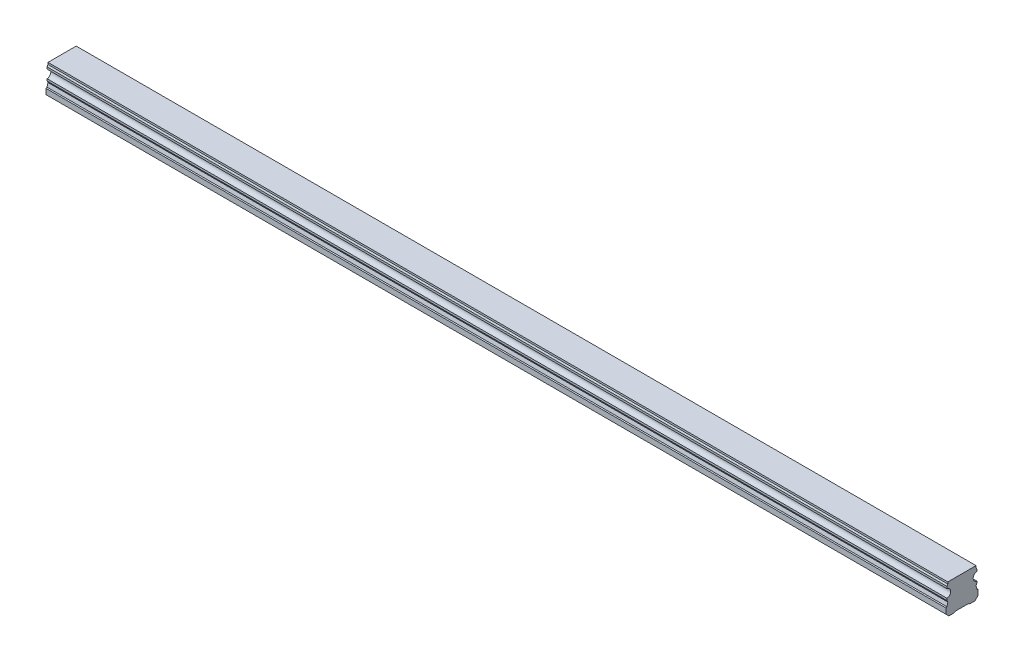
ISO-10303-21;
HEADER;
FILE_DESCRIPTION(('STEP AP214'),'2;1');
FILE_NAME('part.step','',(''),(''),'','','');
FILE_SCHEMA(('AUTOMOTIVE_DESIGN { 1 0 10303 214 1 1 1 1 }'));
ENDSEC;
DATA;
#1=APPLICATION_CONTEXT('core data for automotive mechanical design processes');
#2=APPLICATION_PROTOCOL_DEFINITION('international standard','automotive_design',2000,#1);
#3=PRODUCT_CONTEXT('',#1,'mechanical');
#4=PRODUCT('Part','Part','',(#3));
#5=PRODUCT_RELATED_PRODUCT_CATEGORY('part','',(#4));
#6=PRODUCT_DEFINITION_FORMATION('','',#4);
#7=PRODUCT_DEFINITION_CONTEXT('part definition',#1,'design');
#8=PRODUCT_DEFINITION('design','',#6,#7);
#9=PRODUCT_DEFINITION_SHAPE('','',#8);
#10=(LENGTH_UNIT() NAMED_UNIT(*) SI_UNIT(.MILLI.,.METRE.));
#11=(NAMED_UNIT(*) PLANE_ANGLE_UNIT() SI_UNIT($,.RADIAN.));
#12=(NAMED_UNIT(*) SI_UNIT($,.STERADIAN.) SOLID_ANGLE_UNIT());
#13=UNCERTAINTY_MEASURE_WITH_UNIT(LENGTH_MEASURE(1.E-05),#10,'distance_accuracy_value','');
#14=(GEOMETRIC_REPRESENTATION_CONTEXT(3) GLOBAL_UNCERTAINTY_ASSIGNED_CONTEXT((#13)) GLOBAL_UNIT_ASSIGNED_CONTEXT((#10,
#11,#12)) REPRESENTATION_CONTEXT('',''));
#15=CARTESIAN_POINT('',(0.,0.,0.));
#16=DIRECTION('',(0.,0.,1.));
#17=DIRECTION('',(1.,0.,0.));
#18=AXIS2_PLACEMENT_3D('',#15,#16,#17);
#19=CARTESIAN_POINT('',(390.,0.399999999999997,0.));
#20=DIRECTION('',(0.,-1.,0.));
#21=DIRECTION('',(0.,0.,-1.));
#22=AXIS2_PLACEMENT_3D('',#19,#20,#21);
#23=CONICAL_SURFACE('',#22,2.89999999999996,0.785398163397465);
#24=CARTESIAN_POINT('',(390.,0.799999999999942,0.));
#25=DIRECTION('',(0.,1.,0.));
#26=DIRECTION('',(0.,0.,1.));
#27=AXIS2_PLACEMENT_3D('',#24,#25,#26);
#28=CIRCLE('',#27,2.5);
#29=CARTESIAN_POINT('',(390.,0.79999999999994,-2.5));
#30=VERTEX_POINT('',#29);
#31=EDGE_CURVE('E11',#30,#30,#28,.F.);
#32=CARTESIAN_POINT('',(390.,0.399999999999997,0.));
#33=DIRECTION('',(0.,1.,0.));
#34=DIRECTION('',(0.,0.,1.));
#35=AXIS2_PLACEMENT_3D('',#32,#33,#34);
#36=CIRCLE('',#35,2.89999999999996);
#37=CARTESIAN_POINT('',(390.,0.399999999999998,-2.89999999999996));
#38=VERTEX_POINT('',#37);
#39=EDGE_CURVE('E482',#38,#38,#36,.T.);
#40=CARTESIAN_POINT('',(390.,0.79999999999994,-2.5));
#41=CARTESIAN_POINT('',(390.,0.795833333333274,-2.50416666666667));
#42=CARTESIAN_POINT('',(390.,0.791666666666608,-2.50833333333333));
#43=CARTESIAN_POINT('',(390.,0.783333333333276,-2.51666666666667));
#44=CARTESIAN_POINT('',(390.,0.77916666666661,-2.52083333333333));
#45=CARTESIAN_POINT('',(390.,0.770833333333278,-2.52916666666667));
#46=CARTESIAN_POINT('',(390.,0.766666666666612,-2.53333333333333));
#47=CARTESIAN_POINT('',(390.,0.75833333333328,-2.54166666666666));
#48=CARTESIAN_POINT('',(390.,0.754166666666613,-2.54583333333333));
#49=CARTESIAN_POINT('',(390.,0.745833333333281,-2.55416666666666));
#50=CARTESIAN_POINT('',(390.,0.741666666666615,-2.55833333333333));
#51=CARTESIAN_POINT('',(390.,0.733333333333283,-2.56666666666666));
#52=CARTESIAN_POINT('',(390.,0.729166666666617,-2.57083333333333));
#53=CARTESIAN_POINT('',(390.,0.720833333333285,-2.57916666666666));
#54=CARTESIAN_POINT('',(390.,0.716666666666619,-2.58333333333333));
#55=CARTESIAN_POINT('',(390.,0.708333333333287,-2.59166666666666));
#56=CARTESIAN_POINT('',(390.,0.704166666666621,-2.59583333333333));
#57=CARTESIAN_POINT('',(390.,0.695833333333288,-2.60416666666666));
#58=CARTESIAN_POINT('',(390.,0.691666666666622,-2.60833333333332));
#59=CARTESIAN_POINT('',(390.,0.68333333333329,-2.61666666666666));
#60=CARTESIAN_POINT('',(390.,0.679166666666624,-2.62083333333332));
#61=CARTESIAN_POINT('',(390.,0.670833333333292,-2.62916666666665));
#62=CARTESIAN_POINT('',(390.,0.666666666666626,-2.63333333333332));
#63=CARTESIAN_POINT('',(390.,0.658333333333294,-2.64166666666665));
#64=CARTESIAN_POINT('',(390.,0.654166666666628,-2.64583333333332));
#65=CARTESIAN_POINT('',(390.,0.645833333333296,-2.65416666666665));
#66=CARTESIAN_POINT('',(390.,0.64166666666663,-2.65833333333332));
#67=CARTESIAN_POINT('',(390.,0.633333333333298,-2.66666666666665));
#68=CARTESIAN_POINT('',(390.,0.629166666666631,-2.67083333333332));
#69=CARTESIAN_POINT('',(390.,0.620833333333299,-2.67916666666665));
#70=CARTESIAN_POINT('',(390.,0.616666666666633,-2.68333333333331));
#71=CARTESIAN_POINT('',(390.,0.608333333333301,-2.69166666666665));
#72=CARTESIAN_POINT('',(390.,0.604166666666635,-2.69583333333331));
#73=CARTESIAN_POINT('',(390.,0.595833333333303,-2.70416666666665));
#74=CARTESIAN_POINT('',(390.,0.591666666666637,-2.70833333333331));
#75=CARTESIAN_POINT('',(390.,0.583333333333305,-2.71666666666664));
#76=CARTESIAN_POINT('',(390.,0.579166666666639,-2.72083333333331));
#77=CARTESIAN_POINT('',(390.,0.570833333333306,-2.72916666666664));
#78=CARTESIAN_POINT('',(390.,0.56666666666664,-2.73333333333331));
#79=CARTESIAN_POINT('',(390.,0.558333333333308,-2.74166666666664));
#80=CARTESIAN_POINT('',(390.,0.554166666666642,-2.74583333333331));
#81=CARTESIAN_POINT('',(390.,0.54583333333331,-2.75416666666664));
#82=CARTESIAN_POINT('',(390.,0.541666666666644,-2.75833333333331));
#83=CARTESIAN_POINT('',(390.,0.533333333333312,-2.76666666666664));
#84=CARTESIAN_POINT('',(390.,0.529166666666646,-2.77083333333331));
#85=CARTESIAN_POINT('',(390.,0.520833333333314,-2.77916666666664));
#86=CARTESIAN_POINT('',(390.,0.516666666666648,-2.7833333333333));
#87=CARTESIAN_POINT('',(390.,0.508333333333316,-2.79166666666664));
#88=CARTESIAN_POINT('',(390.,0.504166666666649,-2.7958333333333));
#89=CARTESIAN_POINT('',(390.,0.495833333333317,-2.80416666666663));
#90=CARTESIAN_POINT('',(390.,0.491666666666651,-2.8083333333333));
#91=CARTESIAN_POINT('',(390.,0.483333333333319,-2.81666666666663));
#92=CARTESIAN_POINT('',(390.,0.479166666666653,-2.8208333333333));
#93=CARTESIAN_POINT('',(390.,0.470833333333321,-2.82916666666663));
#94=CARTESIAN_POINT('',(390.,0.466666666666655,-2.8333333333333));
#95=CARTESIAN_POINT('',(390.,0.458333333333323,-2.84166666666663));
#96=CARTESIAN_POINT('',(390.,0.454166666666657,-2.8458333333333));
#97=CARTESIAN_POINT('',(390.,0.445833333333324,-2.85416666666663));
#98=CARTESIAN_POINT('',(390.,0.441666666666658,-2.8583333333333));
#99=CARTESIAN_POINT('',(390.,0.433333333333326,-2.86666666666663));
#100=CARTESIAN_POINT('',(390.,0.42916666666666,-2.87083333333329));
#101=CARTESIAN_POINT('',(390.,0.420833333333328,-2.87916666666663));
#102=CARTESIAN_POINT('',(390.,0.416666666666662,-2.88333333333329));
#103=CARTESIAN_POINT('',(390.,0.40833333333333,-2.89166666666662));
#104=CARTESIAN_POINT('',(390.,0.404166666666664,-2.89583333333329));
#105=CARTESIAN_POINT('',(390.,0.399999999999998,-2.89999999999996));
#106=B_SPLINE_CURVE_WITH_KNOTS('',3,(#40,#41,#42,#43,#44,#45,#46,#47,#48,#49,#50,#51,#52,#53,
#54,#55,#56,#57,#58,#59,#60,#61,#62,#63,#64,#65,#66,#67,#68,#69,#70,#71,#72,#73,#74,#75,#76,#77,
#78,#79,#80,#81,#82,#83,#84,#85,#86,#87,#88,#89,#90,#91,#92,#93,#94,#95,#96,#97,#98,#99,#100,
#101,#102,#103,#104,#105),.UNSPECIFIED.,.F.,.F.,(4,2,2,2,2,2,2,2,2,2,2,2,2,2,2,2,2,2,2,2,2,2,2,
2,2,2,2,2,2,2,2,2,4),(0.,0.0176776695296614,0.0353553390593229,0.0530330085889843,
0.0707106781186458,0.0883883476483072,0.106066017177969,0.12374368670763,0.141421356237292,
0.159099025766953,0.176776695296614,0.194454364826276,0.212132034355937,0.229809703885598,
0.24748737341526,0.265165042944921,0.282842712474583,0.300520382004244,0.318198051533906,
0.335875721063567,0.353553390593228,0.37123106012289,0.388908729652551,0.406586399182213,
0.424264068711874,0.441941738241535,0.459619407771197,0.477297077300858,0.49497474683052,
0.512652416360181,0.530330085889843,0.548007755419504,0.565685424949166),.UNSPECIFIED.);
#107=EDGE_CURVE('BSEAM39',#30,#38,#106,.T.);
#108=ORIENTED_EDGE('',*,*,#31,.F.);
#109=ORIENTED_EDGE('',*,*,#39,.F.);
#110=ORIENTED_EDGE('',*,*,#107,.T.);
#111=ORIENTED_EDGE('',*,*,#107,.F.);
#112=EDGE_LOOP('',(#108,#110,#109,#111));
#113=FACE_BOUND('',#112,.T.);
#114=ADVANCED_FACE('F39',(#113),#23,.F.);
#115=CARTESIAN_POINT('',(390.,7.,0.));
#116=DIRECTION('',(0.,-1.,0.));
#117=DIRECTION('',(0.,0.,-1.));
#118=AXIS2_PLACEMENT_3D('',#115,#116,#117);
#119=CYLINDRICAL_SURFACE('',#118,2.5);
#120=ORIENTED_EDGE('',*,*,#31,.T.);
#121=EDGE_LOOP('',(#120));
#122=FACE_BOUND('',#121,.T.);
#123=CARTESIAN_POINT('',(390.,7.,0.));
#124=DIRECTION('',(0.,-1.,0.));
#125=DIRECTION('',(0.,0.,-1.));
#126=AXIS2_PLACEMENT_3D('',#123,#124,#125);
#127=CIRCLE('',#126,2.5);
#128=CARTESIAN_POINT('',(390.,7.,-2.50000000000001));
#129=VERTEX_POINT('',#128);
#130=EDGE_CURVE('E49',#129,#129,#127,.T.);
#131=ORIENTED_EDGE('',*,*,#130,.F.);
#132=EDGE_LOOP('',(#131));
#133=FACE_BOUND('',#132,.T.);
#134=ADVANCED_FACE('F644',(#122,#133),#119,.F.);
#135=CARTESIAN_POINT('',(390.,7.,0.));
#136=DIRECTION('',(0.,-1.,0.));
#137=DIRECTION('',(0.,0.,-1.));
#138=AXIS2_PLACEMENT_3D('',#135,#136,#137);
#139=PLANE('',#138);
#140=CARTESIAN_POINT('',(390.,7.,0.));
#141=DIRECTION('',(0.,-1.,0.));
#142=DIRECTION('',(0.,0.,-1.));
#143=AXIS2_PLACEMENT_3D('',#140,#141,#142);
#144=CIRCLE('',#143,2.1);
#145=CARTESIAN_POINT('',(390.,7.,-2.1));
#146=VERTEX_POINT('',#145);
#147=EDGE_CURVE('E42',#146,#146,#144,.T.);
#148=ORIENTED_EDGE('',*,*,#147,.F.);
#149=EDGE_LOOP('',(#148));
#150=FACE_BOUND('',#149,.T.);
#151=ORIENTED_EDGE('',*,*,#130,.T.);
#152=EDGE_LOOP('',(#151));
#153=FACE_BOUND('',#152,.T.);
#154=ADVANCED_FACE('F649',(#150,#153),#139,.T.);
#155=CARTESIAN_POINT('',(330.,0.399999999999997,0.));
#156=DIRECTION('',(0.,-1.,0.));
#157=DIRECTION('',(0.,0.,-1.));
#158=AXIS2_PLACEMENT_3D('',#155,#156,#157);
#159=CONICAL_SURFACE('',#158,2.89999999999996,0.785398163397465);
#160=CARTESIAN_POINT('',(330.,0.799999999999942,0.));
#161=DIRECTION('',(0.,1.,0.));
#162=DIRECTION('',(0.,0.,1.));
#163=AXIS2_PLACEMENT_3D('',#160,#161,#162);
#164=CIRCLE('',#163,2.5);
#165=CARTESIAN_POINT('',(330.,0.79999999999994,-2.5));
#166=VERTEX_POINT('',#165);
#167=EDGE_CURVE('E478',#166,#166,#164,.F.);
#168=CARTESIAN_POINT('',(330.,0.399999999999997,0.));
#169=DIRECTION('',(0.,1.,0.));
#170=DIRECTION('',(0.,0.,1.));
#171=AXIS2_PLACEMENT_3D('',#168,#169,#170);
#172=CIRCLE('',#171,2.89999999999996);
#173=CARTESIAN_POINT('',(330.,0.399999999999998,-2.89999999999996));
#174=VERTEX_POINT('',#173);
#175=EDGE_CURVE('E470',#174,#174,#172,.T.);
#176=CARTESIAN_POINT('',(330.,0.79999999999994,-2.5));
#177=CARTESIAN_POINT('',(330.,0.795833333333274,-2.50416666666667));
#178=CARTESIAN_POINT('',(330.,0.791666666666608,-2.50833333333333));
#179=CARTESIAN_POINT('',(330.,0.783333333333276,-2.51666666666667));
#180=CARTESIAN_POINT('',(330.,0.77916666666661,-2.52083333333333));
#181=CARTESIAN_POINT('',(330.,0.770833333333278,-2.52916666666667));
#182=CARTESIAN_POINT('',(330.,0.766666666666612,-2.53333333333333));
#183=CARTESIAN_POINT('',(330.,0.75833333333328,-2.54166666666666));
#184=CARTESIAN_POINT('',(330.,0.754166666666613,-2.54583333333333));
#185=CARTESIAN_POINT('',(330.,0.745833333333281,-2.55416666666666));
#186=CARTESIAN_POINT('',(330.,0.741666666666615,-2.55833333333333));
#187=CARTESIAN_POINT('',(330.,0.733333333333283,-2.56666666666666));
#188=CARTESIAN_POINT('',(330.,0.729166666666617,-2.57083333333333));
#189=CARTESIAN_POINT('',(330.,0.720833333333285,-2.57916666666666));
#190=CARTESIAN_POINT('',(330.,0.716666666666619,-2.58333333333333));
#191=CARTESIAN_POINT('',(330.,0.708333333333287,-2.59166666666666));
#192=CARTESIAN_POINT('',(330.,0.704166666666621,-2.59583333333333));
#193=CARTESIAN_POINT('',(330.,0.695833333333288,-2.60416666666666));
#194=CARTESIAN_POINT('',(330.,0.691666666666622,-2.60833333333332));
#195=CARTESIAN_POINT('',(330.,0.68333333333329,-2.61666666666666));
#196=CARTESIAN_POINT('',(330.,0.679166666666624,-2.62083333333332));
#197=CARTESIAN_POINT('',(330.,0.670833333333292,-2.62916666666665));
#198=CARTESIAN_POINT('',(330.,0.666666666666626,-2.63333333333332));
#199=CARTESIAN_POINT('',(330.,0.658333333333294,-2.64166666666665));
#200=CARTESIAN_POINT('',(330.,0.654166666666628,-2.64583333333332));
#201=CARTESIAN_POINT('',(330.,0.645833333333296,-2.65416666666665));
#202=CARTESIAN_POINT('',(330.,0.64166666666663,-2.65833333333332));
#203=CARTESIAN_POINT('',(330.,0.633333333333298,-2.66666666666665));
#204=CARTESIAN_POINT('',(330.,0.629166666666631,-2.67083333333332));
#205=CARTESIAN_POINT('',(330.,0.620833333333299,-2.67916666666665));
#206=CARTESIAN_POINT('',(330.,0.616666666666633,-2.68333333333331));
#207=CARTESIAN_POINT('',(330.,0.608333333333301,-2.69166666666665));
#208=CARTESIAN_POINT('',(330.,0.604166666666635,-2.69583333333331));
#209=CARTESIAN_POINT('',(330.,0.595833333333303,-2.70416666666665));
#210=CARTESIAN_POINT('',(330.,0.591666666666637,-2.70833333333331));
#211=CARTESIAN_POINT('',(330.,0.583333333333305,-2.71666666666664));
#212=CARTESIAN_POINT('',(330.,0.579166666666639,-2.72083333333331));
#213=CARTESIAN_POINT('',(330.,0.570833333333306,-2.72916666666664));
#214=CARTESIAN_POINT('',(330.,0.56666666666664,-2.73333333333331));
#215=CARTESIAN_POINT('',(330.,0.558333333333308,-2.74166666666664));
#216=CARTESIAN_POINT('',(330.,0.554166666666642,-2.74583333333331));
#217=CARTESIAN_POINT('',(330.,0.54583333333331,-2.75416666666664));
#218=CARTESIAN_POINT('',(330.,0.541666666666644,-2.75833333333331));
#219=CARTESIAN_POINT('',(330.,0.533333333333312,-2.76666666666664));
#220=CARTESIAN_POINT('',(330.,0.529166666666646,-2.77083333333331));
#221=CARTESIAN_POINT('',(330.,0.520833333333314,-2.77916666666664));
#222=CARTESIAN_POINT('',(330.,0.516666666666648,-2.7833333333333));
#223=CARTESIAN_POINT('',(330.,0.508333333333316,-2.79166666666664));
#224=CARTESIAN_POINT('',(330.,0.504166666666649,-2.7958333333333));
#225=CARTESIAN_POINT('',(330.,0.495833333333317,-2.80416666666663));
#226=CARTESIAN_POINT('',(330.,0.491666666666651,-2.8083333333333));
#227=CARTESIAN_POINT('',(330.,0.483333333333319,-2.81666666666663));
#228=CARTESIAN_POINT('',(330.,0.479166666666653,-2.8208333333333));
#229=CARTESIAN_POINT('',(330.,0.470833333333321,-2.82916666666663));
#230=CARTESIAN_POINT('',(330.,0.466666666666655,-2.8333333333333));
#231=CARTESIAN_POINT('',(330.,0.458333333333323,-2.84166666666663));
#232=CARTESIAN_POINT('',(330.,0.454166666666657,-2.8458333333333));
#233=CARTESIAN_POINT('',(330.,0.445833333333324,-2.85416666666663));
#234=CARTESIAN_POINT('',(330.,0.441666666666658,-2.8583333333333));
#235=CARTESIAN_POINT('',(330.,0.433333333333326,-2.86666666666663));
#236=CARTESIAN_POINT('',(330.,0.42916666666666,-2.87083333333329));
#237=CARTESIAN_POINT('',(330.,0.420833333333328,-2.87916666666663));
#238=CARTESIAN_POINT('',(330.,0.416666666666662,-2.88333333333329));
#239=CARTESIAN_POINT('',(330.,0.40833333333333,-2.89166666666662));
#240=CARTESIAN_POINT('',(330.,0.404166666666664,-2.89583333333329));
#241=CARTESIAN_POINT('',(330.,0.399999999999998,-2.89999999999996));
#242=B_SPLINE_CURVE_WITH_KNOTS('',3,(#176,#177,#178,#179,#180,#181,#182,#183,#184,#185,#186,
#187,#188,#189,#190,#191,#192,#193,#194,#195,#196,#197,#198,#199,#200,#201,#202,#203,#204,#205,
#206,#207,#208,#209,#210,#211,#212,#213,#214,#215,#216,#217,#218,#219,#220,#221,#222,#223,#224,
#225,#226,#227,#228,#229,#230,#231,#232,#233,#234,#235,#236,#237,#238,#239,#240,#241),
.UNSPECIFIED.,.F.,.F.,(4,2,2,2,2,2,2,2,2,2,2,2,2,2,2,2,2,2,2,2,2,2,2,2,2,2,2,2,2,2,2,2,4),(0.,
0.0176776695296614,0.0353553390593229,0.0530330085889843,0.0707106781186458,0.0883883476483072,
0.106066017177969,0.12374368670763,0.141421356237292,0.159099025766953,0.176776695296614,
0.194454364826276,0.212132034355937,0.229809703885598,0.24748737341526,0.265165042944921,
0.282842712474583,0.300520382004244,0.318198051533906,0.335875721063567,0.353553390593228,
0.37123106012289,0.388908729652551,0.406586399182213,0.424264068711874,0.441941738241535,
0.459619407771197,0.477297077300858,0.49497474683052,0.512652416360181,0.530330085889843,
0.548007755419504,0.565685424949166),.UNSPECIFIED.);
#243=EDGE_CURVE('BSEAM772',#166,#174,#242,.T.);
#244=ORIENTED_EDGE('',*,*,#167,.F.);
#245=ORIENTED_EDGE('',*,*,#175,.F.);
#246=ORIENTED_EDGE('',*,*,#243,.T.);
#247=ORIENTED_EDGE('',*,*,#243,.F.);
#248=EDGE_LOOP('',(#244,#246,#245,#247));
#249=FACE_BOUND('',#248,.T.);
#250=ADVANCED_FACE('F772',(#249),#159,.F.);
#251=CARTESIAN_POINT('',(330.,7.,0.));
#252=DIRECTION('',(0.,-1.,0.));
#253=DIRECTION('',(0.,0.,-1.));
#254=AXIS2_PLACEMENT_3D('',#251,#252,#253);
#255=CYLINDRICAL_SURFACE('',#254,2.5);
#256=ORIENTED_EDGE('',*,*,#167,.T.);
#257=EDGE_LOOP('',(#256));
#258=FACE_BOUND('',#257,.T.);
#259=CARTESIAN_POINT('',(330.,7.,0.));
#260=DIRECTION('',(0.,-1.,0.));
#261=DIRECTION('',(0.,0.,-1.));
#262=AXIS2_PLACEMENT_3D('',#259,#260,#261);
#263=CIRCLE('',#262,2.5);
#264=CARTESIAN_POINT('',(330.,7.,-2.50000000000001));
#265=VERTEX_POINT('',#264);
#266=EDGE_CURVE('E474',#265,#265,#263,.T.);
#267=ORIENTED_EDGE('',*,*,#266,.F.);
#268=EDGE_LOOP('',(#267));
#269=FACE_BOUND('',#268,.T.);
#270=ADVANCED_FACE('F768',(#258,#269),#255,.F.);
#271=CARTESIAN_POINT('',(330.,7.,0.));
#272=DIRECTION('',(0.,-1.,0.));
#273=DIRECTION('',(0.,0.,-1.));
#274=AXIS2_PLACEMENT_3D('',#271,#272,#273);
#275=PLANE('',#274);
#276=CARTESIAN_POINT('',(330.,7.,0.));
#277=DIRECTION('',(0.,-1.,0.));
#278=DIRECTION('',(0.,0.,-1.));
#279=AXIS2_PLACEMENT_3D('',#276,#277,#278);
#280=CIRCLE('',#279,2.1);
#281=CARTESIAN_POINT('',(330.,7.,-2.1));
#282=VERTEX_POINT('',#281);
#283=EDGE_CURVE('E505',#282,#282,#280,.T.);
#284=ORIENTED_EDGE('',*,*,#283,.F.);
#285=EDGE_LOOP('',(#284));
#286=FACE_BOUND('',#285,.T.);
#287=ORIENTED_EDGE('',*,*,#266,.T.);
#288=EDGE_LOOP('',(#287));
#289=FACE_BOUND('',#288,.T.);
#290=ADVANCED_FACE('F764',(#286,#289),#275,.T.);
#291=CARTESIAN_POINT('',(270.,0.399999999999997,0.));
#292=DIRECTION('',(0.,-1.,0.));
#293=DIRECTION('',(0.,0.,-1.));
#294=AXIS2_PLACEMENT_3D('',#291,#292,#293);
#295=CONICAL_SURFACE('',#294,2.89999999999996,0.785398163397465);
#296=CARTESIAN_POINT('',(270.,0.799999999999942,0.));
#297=DIRECTION('',(0.,1.,0.));
#298=DIRECTION('',(0.,0.,1.));
#299=AXIS2_PLACEMENT_3D('',#296,#297,#298);
#300=CIRCLE('',#299,2.5);
#301=CARTESIAN_POINT('',(270.,0.79999999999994,-2.5));
#302=VERTEX_POINT('',#301);
#303=EDGE_CURVE('E466',#302,#302,#300,.F.);
#304=CARTESIAN_POINT('',(270.,0.399999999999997,0.));
#305=DIRECTION('',(0.,1.,0.));
#306=DIRECTION('',(0.,0.,1.));
#307=AXIS2_PLACEMENT_3D('',#304,#305,#306);
#308=CIRCLE('',#307,2.89999999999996);
#309=CARTESIAN_POINT('',(270.,0.399999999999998,-2.89999999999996));
#310=VERTEX_POINT('',#309);
#311=EDGE_CURVE('E458',#310,#310,#308,.T.);
#312=CARTESIAN_POINT('',(270.,0.79999999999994,-2.5));
#313=CARTESIAN_POINT('',(270.,0.795833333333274,-2.50416666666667));
#314=CARTESIAN_POINT('',(270.,0.791666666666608,-2.50833333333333));
#315=CARTESIAN_POINT('',(270.,0.783333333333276,-2.51666666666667));
#316=CARTESIAN_POINT('',(270.,0.77916666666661,-2.52083333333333));
#317=CARTESIAN_POINT('',(270.,0.770833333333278,-2.52916666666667));
#318=CARTESIAN_POINT('',(270.,0.766666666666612,-2.53333333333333));
#319=CARTESIAN_POINT('',(270.,0.75833333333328,-2.54166666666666));
#320=CARTESIAN_POINT('',(270.,0.754166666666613,-2.54583333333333));
#321=CARTESIAN_POINT('',(270.,0.745833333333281,-2.55416666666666));
#322=CARTESIAN_POINT('',(270.,0.741666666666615,-2.55833333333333));
#323=CARTESIAN_POINT('',(270.,0.733333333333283,-2.56666666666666));
#324=CARTESIAN_POINT('',(270.,0.729166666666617,-2.57083333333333));
#325=CARTESIAN_POINT('',(270.,0.720833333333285,-2.57916666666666));
#326=CARTESIAN_POINT('',(270.,0.716666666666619,-2.58333333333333));
#327=CARTESIAN_POINT('',(270.,0.708333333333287,-2.59166666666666));
#328=CARTESIAN_POINT('',(270.,0.704166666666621,-2.59583333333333));
#329=CARTESIAN_POINT('',(270.,0.695833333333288,-2.60416666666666));
#330=CARTESIAN_POINT('',(270.,0.691666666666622,-2.60833333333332));
#331=CARTESIAN_POINT('',(270.,0.68333333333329,-2.61666666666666));
#332=CARTESIAN_POINT('',(270.,0.679166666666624,-2.62083333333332));
#333=CARTESIAN_POINT('',(270.,0.670833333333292,-2.62916666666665));
#334=CARTESIAN_POINT('',(270.,0.666666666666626,-2.63333333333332));
#335=CARTESIAN_POINT('',(270.,0.658333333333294,-2.64166666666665));
#336=CARTESIAN_POINT('',(270.,0.654166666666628,-2.64583333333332));
#337=CARTESIAN_POINT('',(270.,0.645833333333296,-2.65416666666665));
#338=CARTESIAN_POINT('',(270.,0.64166666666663,-2.65833333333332));
#339=CARTESIAN_POINT('',(270.,0.633333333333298,-2.66666666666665));
#340=CARTESIAN_POINT('',(270.,0.629166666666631,-2.67083333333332));
#341=CARTESIAN_POINT('',(270.,0.620833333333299,-2.67916666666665));
#342=CARTESIAN_POINT('',(270.,0.616666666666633,-2.68333333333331));
#343=CARTESIAN_POINT('',(270.,0.608333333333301,-2.69166666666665));
#344=CARTESIAN_POINT('',(270.,0.604166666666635,-2.69583333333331));
#345=CARTESIAN_POINT('',(270.,0.595833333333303,-2.70416666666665));
#346=CARTESIAN_POINT('',(270.,0.591666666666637,-2.70833333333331));
#347=CARTESIAN_POINT('',(270.,0.583333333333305,-2.71666666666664));
#348=CARTESIAN_POINT('',(270.,0.579166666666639,-2.72083333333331));
#349=CARTESIAN_POINT('',(270.,0.570833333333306,-2.72916666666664));
#350=CARTESIAN_POINT('',(270.,0.56666666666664,-2.73333333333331));
#351=CARTESIAN_POINT('',(270.,0.558333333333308,-2.74166666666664));
#352=CARTESIAN_POINT('',(270.,0.554166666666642,-2.74583333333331));
#353=CARTESIAN_POINT('',(270.,0.54583333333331,-2.75416666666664));
#354=CARTESIAN_POINT('',(270.,0.541666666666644,-2.75833333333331));
#355=CARTESIAN_POINT('',(270.,0.533333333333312,-2.76666666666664));
#356=CARTESIAN_POINT('',(270.,0.529166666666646,-2.77083333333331));
#357=CARTESIAN_POINT('',(270.,0.520833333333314,-2.77916666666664));
#358=CARTESIAN_POINT('',(270.,0.516666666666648,-2.7833333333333));
#359=CARTESIAN_POINT('',(270.,0.508333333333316,-2.79166666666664));
#360=CARTESIAN_POINT('',(270.,0.504166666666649,-2.7958333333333));
#361=CARTESIAN_POINT('',(270.,0.495833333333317,-2.80416666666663));
#362=CARTESIAN_POINT('',(270.,0.491666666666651,-2.8083333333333));
#363=CARTESIAN_POINT('',(270.,0.483333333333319,-2.81666666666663));
#364=CARTESIAN_POINT('',(270.,0.479166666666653,-2.8208333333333));
#365=CARTESIAN_POINT('',(270.,0.470833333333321,-2.82916666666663));
#366=CARTESIAN_POINT('',(270.,0.466666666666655,-2.8333333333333));
#367=CARTESIAN_POINT('',(270.,0.458333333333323,-2.84166666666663));
#368=CARTESIAN_POINT('',(270.,0.454166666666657,-2.8458333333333));
#369=CARTESIAN_POINT('',(270.,0.445833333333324,-2.85416666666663));
#370=CARTESIAN_POINT('',(270.,0.441666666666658,-2.8583333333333));
#371=CARTESIAN_POINT('',(270.,0.433333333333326,-2.86666666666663));
#372=CARTESIAN_POINT('',(270.,0.42916666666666,-2.87083333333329));
#373=CARTESIAN_POINT('',(270.,0.420833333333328,-2.87916666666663));
#374=CARTESIAN_POINT('',(270.,0.416666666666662,-2.88333333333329));
#375=CARTESIAN_POINT('',(270.,0.40833333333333,-2.89166666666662));
#376=CARTESIAN_POINT('',(270.,0.404166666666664,-2.89583333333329));
#377=CARTESIAN_POINT('',(270.,0.399999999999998,-2.89999999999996));
#378=B_SPLINE_CURVE_WITH_KNOTS('',3,(#312,#313,#314,#315,#316,#317,#318,#319,#320,#321,#322,
#323,#324,#325,#326,#327,#328,#329,#330,#331,#332,#333,#334,#335,#336,#337,#338,#339,#340,#341,
#342,#343,#344,#345,#346,#347,#348,#349,#350,#351,#352,#353,#354,#355,#356,#357,#358,#359,#360,
#361,#362,#363,#364,#365,#366,#367,#368,#369,#370,#371,#372,#373,#374,#375,#376,#377),
.UNSPECIFIED.,.F.,.F.,(4,2,2,2,2,2,2,2,2,2,2,2,2,2,2,2,2,2,2,2,2,2,2,2,2,2,2,2,2,2,2,2,4),(0.,
0.0176776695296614,0.0353553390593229,0.0530330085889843,0.0707106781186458,0.0883883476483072,
0.106066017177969,0.12374368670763,0.141421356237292,0.159099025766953,0.176776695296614,
0.194454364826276,0.212132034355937,0.229809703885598,0.24748737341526,0.265165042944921,
0.282842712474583,0.300520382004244,0.318198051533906,0.335875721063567,0.353553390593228,
0.37123106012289,0.388908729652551,0.406586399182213,0.424264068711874,0.441941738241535,
0.459619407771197,0.477297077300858,0.49497474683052,0.512652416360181,0.530330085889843,
0.548007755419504,0.565685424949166),.UNSPECIFIED.);
#379=EDGE_CURVE('BSEAM760',#302,#310,#378,.T.);
#380=ORIENTED_EDGE('',*,*,#303,.F.);
#381=ORIENTED_EDGE('',*,*,#311,.F.);
#382=ORIENTED_EDGE('',*,*,#379,.T.);
#383=ORIENTED_EDGE('',*,*,#379,.F.);
#384=EDGE_LOOP('',(#380,#382,#381,#383));
#385=FACE_BOUND('',#384,.T.);
#386=ADVANCED_FACE('F760',(#385),#295,.F.);
#387=CARTESIAN_POINT('',(270.,7.,0.));
#388=DIRECTION('',(0.,-1.,0.));
#389=DIRECTION('',(0.,0.,-1.));
#390=AXIS2_PLACEMENT_3D('',#387,#388,#389);
#391=CYLINDRICAL_SURFACE('',#390,2.5);
#392=ORIENTED_EDGE('',*,*,#303,.T.);
#393=EDGE_LOOP('',(#392));
#394=FACE_BOUND('',#393,.T.);
#395=CARTESIAN_POINT('',(270.,7.,0.));
#396=DIRECTION('',(0.,-1.,0.));
#397=DIRECTION('',(0.,0.,-1.));
#398=AXIS2_PLACEMENT_3D('',#395,#396,#397);
#399=CIRCLE('',#398,2.5);
#400=CARTESIAN_POINT('',(270.,7.,-2.50000000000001));
#401=VERTEX_POINT('',#400);
#402=EDGE_CURVE('E462',#401,#401,#399,.T.);
#403=ORIENTED_EDGE('',*,*,#402,.F.);
#404=EDGE_LOOP('',(#403));
#405=FACE_BOUND('',#404,.T.);
#406=ADVANCED_FACE('F756',(#394,#405),#391,.F.);
#407=CARTESIAN_POINT('',(270.,7.,0.));
#408=DIRECTION('',(0.,-1.,0.));
#409=DIRECTION('',(0.,0.,-1.));
#410=AXIS2_PLACEMENT_3D('',#407,#408,#409);
#411=PLANE('',#410);
#412=CARTESIAN_POINT('',(270.,7.,0.));
#413=DIRECTION('',(0.,-1.,0.));
#414=DIRECTION('',(0.,0.,-1.));
#415=AXIS2_PLACEMENT_3D('',#412,#413,#414);
#416=CIRCLE('',#415,2.1);
#417=CARTESIAN_POINT('',(270.,7.,-2.1));
#418=VERTEX_POINT('',#417);
#419=EDGE_CURVE('E502',#418,#418,#416,.T.);
#420=ORIENTED_EDGE('',*,*,#419,.F.);
#421=EDGE_LOOP('',(#420));
#422=FACE_BOUND('',#421,.T.);
#423=ORIENTED_EDGE('',*,*,#402,.T.);
#424=EDGE_LOOP('',(#423));
#425=FACE_BOUND('',#424,.T.);
#426=ADVANCED_FACE('F752',(#422,#425),#411,.T.);
#427=CARTESIAN_POINT('',(210.,0.399999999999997,0.));
#428=DIRECTION('',(0.,-1.,0.));
#429=DIRECTION('',(0.,0.,-1.));
#430=AXIS2_PLACEMENT_3D('',#427,#428,#429);
#431=CONICAL_SURFACE('',#430,2.89999999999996,0.785398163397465);
#432=CARTESIAN_POINT('',(210.,0.799999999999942,0.));
#433=DIRECTION('',(0.,1.,0.));
#434=DIRECTION('',(0.,0.,1.));
#435=AXIS2_PLACEMENT_3D('',#432,#433,#434);
#436=CIRCLE('',#435,2.5);
#437=CARTESIAN_POINT('',(210.,0.79999999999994,-2.5));
#438=VERTEX_POINT('',#437);
#439=EDGE_CURVE('E454',#438,#438,#436,.F.);
#440=CARTESIAN_POINT('',(210.,0.399999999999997,0.));
#441=DIRECTION('',(0.,1.,0.));
#442=DIRECTION('',(0.,0.,1.));
#443=AXIS2_PLACEMENT_3D('',#440,#441,#442);
#444=CIRCLE('',#443,2.89999999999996);
#445=CARTESIAN_POINT('',(210.,0.399999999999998,-2.89999999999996));
#446=VERTEX_POINT('',#445);
#447=EDGE_CURVE('E446',#446,#446,#444,.T.);
#448=CARTESIAN_POINT('',(210.,0.79999999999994,-2.5));
#449=CARTESIAN_POINT('',(210.,0.795833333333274,-2.50416666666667));
#450=CARTESIAN_POINT('',(210.,0.791666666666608,-2.50833333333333));
#451=CARTESIAN_POINT('',(210.,0.783333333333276,-2.51666666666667));
#452=CARTESIAN_POINT('',(210.,0.77916666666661,-2.52083333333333));
#453=CARTESIAN_POINT('',(210.,0.770833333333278,-2.52916666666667));
#454=CARTESIAN_POINT('',(210.,0.766666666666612,-2.53333333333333));
#455=CARTESIAN_POINT('',(210.,0.75833333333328,-2.54166666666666));
#456=CARTESIAN_POINT('',(210.,0.754166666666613,-2.54583333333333));
#457=CARTESIAN_POINT('',(210.,0.745833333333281,-2.55416666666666));
#458=CARTESIAN_POINT('',(210.,0.741666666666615,-2.55833333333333));
#459=CARTESIAN_POINT('',(210.,0.733333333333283,-2.56666666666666));
#460=CARTESIAN_POINT('',(210.,0.729166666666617,-2.57083333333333));
#461=CARTESIAN_POINT('',(210.,0.720833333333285,-2.57916666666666));
#462=CARTESIAN_POINT('',(210.,0.716666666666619,-2.58333333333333));
#463=CARTESIAN_POINT('',(210.,0.708333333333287,-2.59166666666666));
#464=CARTESIAN_POINT('',(210.,0.704166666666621,-2.59583333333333));
#465=CARTESIAN_POINT('',(210.,0.695833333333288,-2.60416666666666));
#466=CARTESIAN_POINT('',(210.,0.691666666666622,-2.60833333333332));
#467=CARTESIAN_POINT('',(210.,0.68333333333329,-2.61666666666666));
#468=CARTESIAN_POINT('',(210.,0.679166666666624,-2.62083333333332));
#469=CARTESIAN_POINT('',(210.,0.670833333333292,-2.62916666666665));
#470=CARTESIAN_POINT('',(210.,0.666666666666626,-2.63333333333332));
#471=CARTESIAN_POINT('',(210.,0.658333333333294,-2.64166666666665));
#472=CARTESIAN_POINT('',(210.,0.654166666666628,-2.64583333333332));
#473=CARTESIAN_POINT('',(210.,0.645833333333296,-2.65416666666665));
#474=CARTESIAN_POINT('',(210.,0.64166666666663,-2.65833333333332));
#475=CARTESIAN_POINT('',(210.,0.633333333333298,-2.66666666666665));
#476=CARTESIAN_POINT('',(210.,0.629166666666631,-2.67083333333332));
#477=CARTESIAN_POINT('',(210.,0.620833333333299,-2.67916666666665));
#478=CARTESIAN_POINT('',(210.,0.616666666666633,-2.68333333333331));
#479=CARTESIAN_POINT('',(210.,0.608333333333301,-2.69166666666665));
#480=CARTESIAN_POINT('',(210.,0.604166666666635,-2.69583333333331));
#481=CARTESIAN_POINT('',(210.,0.595833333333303,-2.70416666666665));
#482=CARTESIAN_POINT('',(210.,0.591666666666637,-2.70833333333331));
#483=CARTESIAN_POINT('',(210.,0.583333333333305,-2.71666666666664));
#484=CARTESIAN_POINT('',(210.,0.579166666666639,-2.72083333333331));
#485=CARTESIAN_POINT('',(210.,0.570833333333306,-2.72916666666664));
#486=CARTESIAN_POINT('',(210.,0.56666666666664,-2.73333333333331));
#487=CARTESIAN_POINT('',(210.,0.558333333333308,-2.74166666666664));
#488=CARTESIAN_POINT('',(210.,0.554166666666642,-2.74583333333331));
#489=CARTESIAN_POINT('',(210.,0.54583333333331,-2.75416666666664));
#490=CARTESIAN_POINT('',(210.,0.541666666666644,-2.75833333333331));
#491=CARTESIAN_POINT('',(210.,0.533333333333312,-2.76666666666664));
#492=CARTESIAN_POINT('',(210.,0.529166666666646,-2.77083333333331));
#493=CARTESIAN_POINT('',(210.,0.520833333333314,-2.77916666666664));
#494=CARTESIAN_POINT('',(210.,0.516666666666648,-2.7833333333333));
#495=CARTESIAN_POINT('',(210.,0.508333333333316,-2.79166666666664));
#496=CARTESIAN_POINT('',(210.,0.504166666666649,-2.7958333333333));
#497=CARTESIAN_POINT('',(210.,0.495833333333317,-2.80416666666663));
#498=CARTESIAN_POINT('',(210.,0.491666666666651,-2.8083333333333));
#499=CARTESIAN_POINT('',(210.,0.483333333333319,-2.81666666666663));
#500=CARTESIAN_POINT('',(210.,0.479166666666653,-2.8208333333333));
#501=CARTESIAN_POINT('',(210.,0.470833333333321,-2.82916666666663));
#502=CARTESIAN_POINT('',(210.,0.466666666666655,-2.8333333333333));
#503=CARTESIAN_POINT('',(210.,0.458333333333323,-2.84166666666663));
#504=CARTESIAN_POINT('',(210.,0.454166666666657,-2.8458333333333));
#505=CARTESIAN_POINT('',(210.,0.445833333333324,-2.85416666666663));
#506=CARTESIAN_POINT('',(210.,0.441666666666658,-2.8583333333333));
#507=CARTESIAN_POINT('',(210.,0.433333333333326,-2.86666666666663));
#508=CARTESIAN_POINT('',(210.,0.42916666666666,-2.87083333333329));
#509=CARTESIAN_POINT('',(210.,0.420833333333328,-2.87916666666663));
#510=CARTESIAN_POINT('',(210.,0.416666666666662,-2.88333333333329));
#511=CARTESIAN_POINT('',(210.,0.40833333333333,-2.89166666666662));
#512=CARTESIAN_POINT('',(210.,0.404166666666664,-2.89583333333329));
#513=CARTESIAN_POINT('',(210.,0.399999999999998,-2.89999999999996));
#514=B_SPLINE_CURVE_WITH_KNOTS('',3,(#448,#449,#450,#451,#452,#453,#454,#455,#456,#457,#458,
#459,#460,#461,#462,#463,#464,#465,#466,#467,#468,#469,#470,#471,#472,#473,#474,#475,#476,#477,
#478,#479,#480,#481,#482,#483,#484,#485,#486,#487,#488,#489,#490,#491,#492,#493,#494,#495,#496,
#497,#498,#499,#500,#501,#502,#503,#504,#505,#506,#507,#508,#509,#510,#511,#512,#513),
.UNSPECIFIED.,.F.,.F.,(4,2,2,2,2,2,2,2,2,2,2,2,2,2,2,2,2,2,2,2,2,2,2,2,2,2,2,2,2,2,2,2,4),(0.,
0.0176776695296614,0.0353553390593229,0.0530330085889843,0.0707106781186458,0.0883883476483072,
0.106066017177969,0.12374368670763,0.141421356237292,0.159099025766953,0.176776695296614,
0.194454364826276,0.212132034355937,0.229809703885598,0.24748737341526,0.265165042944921,
0.282842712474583,0.300520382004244,0.318198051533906,0.335875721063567,0.353553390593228,
0.37123106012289,0.388908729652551,0.406586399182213,0.424264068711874,0.441941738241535,
0.459619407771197,0.477297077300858,0.49497474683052,0.512652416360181,0.530330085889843,
0.548007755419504,0.565685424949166),.UNSPECIFIED.);
#515=EDGE_CURVE('BSEAM748',#438,#446,#514,.T.);
#516=ORIENTED_EDGE('',*,*,#439,.F.);
#517=ORIENTED_EDGE('',*,*,#447,.F.);
#518=ORIENTED_EDGE('',*,*,#515,.T.);
#519=ORIENTED_EDGE('',*,*,#515,.F.);
#520=EDGE_LOOP('',(#516,#518,#517,#519));
#521=FACE_BOUND('',#520,.T.);
#522=ADVANCED_FACE('F748',(#521),#431,.F.);
#523=CARTESIAN_POINT('',(210.,7.,0.));
#524=DIRECTION('',(0.,-1.,0.));
#525=DIRECTION('',(0.,0.,-1.));
#526=AXIS2_PLACEMENT_3D('',#523,#524,#525);
#527=CYLINDRICAL_SURFACE('',#526,2.5);
#528=ORIENTED_EDGE('',*,*,#439,.T.);
#529=EDGE_LOOP('',(#528));
#530=FACE_BOUND('',#529,.T.);
#531=CARTESIAN_POINT('',(210.,7.,0.));
#532=DIRECTION('',(0.,-1.,0.));
#533=DIRECTION('',(0.,0.,-1.));
#534=AXIS2_PLACEMENT_3D('',#531,#532,#533);
#535=CIRCLE('',#534,2.5);
#536=CARTESIAN_POINT('',(210.,7.,-2.50000000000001));
#537=VERTEX_POINT('',#536);
#538=EDGE_CURVE('E450',#537,#537,#535,.T.);
#539=ORIENTED_EDGE('',*,*,#538,.F.);
#540=EDGE_LOOP('',(#539));
#541=FACE_BOUND('',#540,.T.);
#542=ADVANCED_FACE('F744',(#530,#541),#527,.F.);
#543=CARTESIAN_POINT('',(210.,7.,0.));
#544=DIRECTION('',(0.,-1.,0.));
#545=DIRECTION('',(0.,0.,-1.));
#546=AXIS2_PLACEMENT_3D('',#543,#544,#545);
#547=PLANE('',#546);
#548=CARTESIAN_POINT('',(210.,7.,0.));
#549=DIRECTION('',(0.,-1.,0.));
#550=DIRECTION('',(0.,0.,-1.));
#551=AXIS2_PLACEMENT_3D('',#548,#549,#550);
#552=CIRCLE('',#551,2.1);
#553=CARTESIAN_POINT('',(210.,7.,-2.1));
#554=VERTEX_POINT('',#553);
#555=EDGE_CURVE('E498',#554,#554,#552,.T.);
#556=ORIENTED_EDGE('',*,*,#555,.F.);
#557=EDGE_LOOP('',(#556));
#558=FACE_BOUND('',#557,.T.);
#559=ORIENTED_EDGE('',*,*,#538,.T.);
#560=EDGE_LOOP('',(#559));
#561=FACE_BOUND('',#560,.T.);
#562=ADVANCED_FACE('F740',(#558,#561),#547,.T.);
#563=CARTESIAN_POINT('',(150.,0.399999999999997,0.));
#564=DIRECTION('',(0.,-1.,0.));
#565=DIRECTION('',(0.,0.,-1.));
#566=AXIS2_PLACEMENT_3D('',#563,#564,#565);
#567=CONICAL_SURFACE('',#566,2.89999999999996,0.785398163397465);
#568=CARTESIAN_POINT('',(150.,0.799999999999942,0.));
#569=DIRECTION('',(0.,1.,0.));
#570=DIRECTION('',(0.,0.,1.));
#571=AXIS2_PLACEMENT_3D('',#568,#569,#570);
#572=CIRCLE('',#571,2.5);
#573=CARTESIAN_POINT('',(150.,0.79999999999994,-2.5));
#574=VERTEX_POINT('',#573);
#575=EDGE_CURVE('E442',#574,#574,#572,.F.);
#576=CARTESIAN_POINT('',(150.,0.399999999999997,0.));
#577=DIRECTION('',(0.,1.,0.));
#578=DIRECTION('',(0.,0.,1.));
#579=AXIS2_PLACEMENT_3D('',#576,#577,#578);
#580=CIRCLE('',#579,2.89999999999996);
#581=CARTESIAN_POINT('',(150.,0.399999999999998,-2.89999999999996));
#582=VERTEX_POINT('',#581);
#583=EDGE_CURVE('E434',#582,#582,#580,.T.);
#584=CARTESIAN_POINT('',(150.,0.79999999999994,-2.5));
#585=CARTESIAN_POINT('',(150.,0.795833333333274,-2.50416666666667));
#586=CARTESIAN_POINT('',(150.,0.791666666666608,-2.50833333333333));
#587=CARTESIAN_POINT('',(150.,0.783333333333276,-2.51666666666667));
#588=CARTESIAN_POINT('',(150.,0.77916666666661,-2.52083333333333));
#589=CARTESIAN_POINT('',(150.,0.770833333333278,-2.52916666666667));
#590=CARTESIAN_POINT('',(150.,0.766666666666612,-2.53333333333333));
#591=CARTESIAN_POINT('',(150.,0.75833333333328,-2.54166666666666));
#592=CARTESIAN_POINT('',(150.,0.754166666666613,-2.54583333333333));
#593=CARTESIAN_POINT('',(150.,0.745833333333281,-2.55416666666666));
#594=CARTESIAN_POINT('',(150.,0.741666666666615,-2.55833333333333));
#595=CARTESIAN_POINT('',(150.,0.733333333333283,-2.56666666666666));
#596=CARTESIAN_POINT('',(150.,0.729166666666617,-2.57083333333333));
#597=CARTESIAN_POINT('',(150.,0.720833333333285,-2.57916666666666));
#598=CARTESIAN_POINT('',(150.,0.716666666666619,-2.58333333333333));
#599=CARTESIAN_POINT('',(150.,0.708333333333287,-2.59166666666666));
#600=CARTESIAN_POINT('',(150.,0.704166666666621,-2.59583333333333));
#601=CARTESIAN_POINT('',(150.,0.695833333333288,-2.60416666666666));
#602=CARTESIAN_POINT('',(150.,0.691666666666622,-2.60833333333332));
#603=CARTESIAN_POINT('',(150.,0.68333333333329,-2.61666666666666));
#604=CARTESIAN_POINT('',(150.,0.679166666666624,-2.62083333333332));
#605=CARTESIAN_POINT('',(150.,0.670833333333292,-2.62916666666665));
#606=CARTESIAN_POINT('',(150.,0.666666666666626,-2.63333333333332));
#607=CARTESIAN_POINT('',(150.,0.658333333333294,-2.64166666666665));
#608=CARTESIAN_POINT('',(150.,0.654166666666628,-2.64583333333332));
#609=CARTESIAN_POINT('',(150.,0.645833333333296,-2.65416666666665));
#610=CARTESIAN_POINT('',(150.,0.64166666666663,-2.65833333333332));
#611=CARTESIAN_POINT('',(150.,0.633333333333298,-2.66666666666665));
#612=CARTESIAN_POINT('',(150.,0.629166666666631,-2.67083333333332));
#613=CARTESIAN_POINT('',(150.,0.620833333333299,-2.67916666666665));
#614=CARTESIAN_POINT('',(150.,0.616666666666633,-2.68333333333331));
#615=CARTESIAN_POINT('',(150.,0.608333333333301,-2.69166666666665));
#616=CARTESIAN_POINT('',(150.,0.604166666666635,-2.69583333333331));
#617=CARTESIAN_POINT('',(150.,0.595833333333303,-2.70416666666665));
#618=CARTESIAN_POINT('',(150.,0.591666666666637,-2.70833333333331));
#619=CARTESIAN_POINT('',(150.,0.583333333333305,-2.71666666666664));
#620=CARTESIAN_POINT('',(150.,0.579166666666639,-2.72083333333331));
#621=CARTESIAN_POINT('',(150.,0.570833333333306,-2.72916666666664));
#622=CARTESIAN_POINT('',(150.,0.56666666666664,-2.73333333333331));
#623=CARTESIAN_POINT('',(150.,0.558333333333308,-2.74166666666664));
#624=CARTESIAN_POINT('',(150.,0.554166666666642,-2.74583333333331));
#625=CARTESIAN_POINT('',(150.,0.54583333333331,-2.75416666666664));
#626=CARTESIAN_POINT('',(150.,0.541666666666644,-2.75833333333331));
#627=CARTESIAN_POINT('',(150.,0.533333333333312,-2.76666666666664));
#628=CARTESIAN_POINT('',(150.,0.529166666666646,-2.77083333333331));
#629=CARTESIAN_POINT('',(150.,0.520833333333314,-2.77916666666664));
#630=CARTESIAN_POINT('',(150.,0.516666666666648,-2.7833333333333));
#631=CARTESIAN_POINT('',(150.,0.508333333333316,-2.79166666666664));
#632=CARTESIAN_POINT('',(150.,0.504166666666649,-2.7958333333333));
#633=CARTESIAN_POINT('',(150.,0.495833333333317,-2.80416666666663));
#634=CARTESIAN_POINT('',(150.,0.491666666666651,-2.8083333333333));
#635=CARTESIAN_POINT('',(150.,0.483333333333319,-2.81666666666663));
#636=CARTESIAN_POINT('',(150.,0.479166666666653,-2.8208333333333));
#637=CARTESIAN_POINT('',(150.,0.470833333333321,-2.82916666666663));
#638=CARTESIAN_POINT('',(150.,0.466666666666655,-2.8333333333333));
#639=CARTESIAN_POINT('',(150.,0.458333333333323,-2.84166666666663));
#640=CARTESIAN_POINT('',(150.,0.454166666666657,-2.8458333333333));
#641=CARTESIAN_POINT('',(150.,0.445833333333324,-2.85416666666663));
#642=CARTESIAN_POINT('',(150.,0.441666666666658,-2.8583333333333));
#643=CARTESIAN_POINT('',(150.,0.433333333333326,-2.86666666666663));
#644=CARTESIAN_POINT('',(150.,0.42916666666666,-2.87083333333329));
#645=CARTESIAN_POINT('',(150.,0.420833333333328,-2.87916666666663));
#646=CARTESIAN_POINT('',(150.,0.416666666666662,-2.88333333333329));
#647=CARTESIAN_POINT('',(150.,0.40833333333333,-2.89166666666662));
#648=CARTESIAN_POINT('',(150.,0.404166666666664,-2.89583333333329));
#649=CARTESIAN_POINT('',(150.,0.399999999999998,-2.89999999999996));
#650=B_SPLINE_CURVE_WITH_KNOTS('',3,(#584,#585,#586,#587,#588,#589,#590,#591,#592,#593,#594,
#595,#596,#597,#598,#599,#600,#601,#602,#603,#604,#605,#606,#607,#608,#609,#610,#611,#612,#613,
#614,#615,#616,#617,#618,#619,#620,#621,#622,#623,#624,#625,#626,#627,#628,#629,#630,#631,#632,
#633,#634,#635,#636,#637,#638,#639,#640,#641,#642,#643,#644,#645,#646,#647,#648,#649),
.UNSPECIFIED.,.F.,.F.,(4,2,2,2,2,2,2,2,2,2,2,2,2,2,2,2,2,2,2,2,2,2,2,2,2,2,2,2,2,2,2,2,4),(0.,
0.0176776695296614,0.0353553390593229,0.0530330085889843,0.0707106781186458,0.0883883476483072,
0.106066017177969,0.12374368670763,0.141421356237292,0.159099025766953,0.176776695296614,
0.194454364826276,0.212132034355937,0.229809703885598,0.24748737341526,0.265165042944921,
0.282842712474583,0.300520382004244,0.318198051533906,0.335875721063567,0.353553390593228,
0.37123106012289,0.388908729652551,0.406586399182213,0.424264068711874,0.441941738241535,
0.459619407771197,0.477297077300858,0.49497474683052,0.512652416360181,0.530330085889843,
0.548007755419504,0.565685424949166),.UNSPECIFIED.);
#651=EDGE_CURVE('BSEAM736',#574,#582,#650,.T.);
#652=ORIENTED_EDGE('',*,*,#575,.F.);
#653=ORIENTED_EDGE('',*,*,#583,.F.);
#654=ORIENTED_EDGE('',*,*,#651,.T.);
#655=ORIENTED_EDGE('',*,*,#651,.F.);
#656=EDGE_LOOP('',(#652,#654,#653,#655));
#657=FACE_BOUND('',#656,.T.);
#658=ADVANCED_FACE('F736',(#657),#567,.F.);
#659=CARTESIAN_POINT('',(150.,7.,0.));
#660=DIRECTION('',(0.,-1.,0.));
#661=DIRECTION('',(0.,0.,-1.));
#662=AXIS2_PLACEMENT_3D('',#659,#660,#661);
#663=CYLINDRICAL_SURFACE('',#662,2.5);
#664=ORIENTED_EDGE('',*,*,#575,.T.);
#665=EDGE_LOOP('',(#664));
#666=FACE_BOUND('',#665,.T.);
#667=CARTESIAN_POINT('',(150.,7.,0.));
#668=DIRECTION('',(0.,-1.,0.));
#669=DIRECTION('',(0.,0.,-1.));
#670=AXIS2_PLACEMENT_3D('',#667,#668,#669);
#671=CIRCLE('',#670,2.5);
#672=CARTESIAN_POINT('',(150.,7.,-2.50000000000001));
#673=VERTEX_POINT('',#672);
#674=EDGE_CURVE('E438',#673,#673,#671,.T.);
#675=ORIENTED_EDGE('',*,*,#674,.F.);
#676=EDGE_LOOP('',(#675));
#677=FACE_BOUND('',#676,.T.);
#678=ADVANCED_FACE('F732',(#666,#677),#663,.F.);
#679=CARTESIAN_POINT('',(150.,7.,0.));
#680=DIRECTION('',(0.,-1.,0.));
#681=DIRECTION('',(0.,0.,-1.));
#682=AXIS2_PLACEMENT_3D('',#679,#680,#681);
#683=PLANE('',#682);
#684=CARTESIAN_POINT('',(150.,7.,0.));
#685=DIRECTION('',(0.,-1.,0.));
#686=DIRECTION('',(0.,0.,-1.));
#687=AXIS2_PLACEMENT_3D('',#684,#685,#686);
#688=CIRCLE('',#687,2.1);
#689=CARTESIAN_POINT('',(150.,7.,-2.1));
#690=VERTEX_POINT('',#689);
#691=EDGE_CURVE('E493',#690,#690,#688,.T.);
#692=ORIENTED_EDGE('',*,*,#691,.F.);
#693=EDGE_LOOP('',(#692));
#694=FACE_BOUND('',#693,.T.);
#695=ORIENTED_EDGE('',*,*,#674,.T.);
#696=EDGE_LOOP('',(#695));
#697=FACE_BOUND('',#696,.T.);
#698=ADVANCED_FACE('F722',(#694,#697),#683,.T.);
#699=CARTESIAN_POINT('',(420.,14.,-6.59000000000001));
#700=DIRECTION('',(0.,0.,1.));
#701=DIRECTION('',(0.,-1.,0.));
#702=AXIS2_PLACEMENT_3D('',#699,#700,#701);
#703=PLANE('',#702);
#704=DIRECTION('',(0.,1.,0.));
#705=VECTOR('',#704,1.);
#706=CARTESIAN_POINT('',(0.,14.,-6.59000000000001));
#707=LINE('',#706,#705);
#708=CARTESIAN_POINT('',(0.,13.15,-6.59));
#709=VERTEX_POINT('',#708);
#710=CARTESIAN_POINT('',(0.,14.,-6.59000000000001));
#711=VERTEX_POINT('',#710);
#712=EDGE_CURVE('E255',#709,#711,#707,.T.);
#713=ORIENTED_EDGE('',*,*,#712,.T.);
#714=DIRECTION('',(-1.,0.,0.));
#715=VECTOR('',#714,1.);
#716=CARTESIAN_POINT('',(420.,14.,-6.59000000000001));
#717=LINE('',#716,#715);
#718=CARTESIAN_POINT('',(420.,14.,-6.59000000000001));
#719=VERTEX_POINT('',#718);
#720=EDGE_CURVE('E423',#719,#711,#717,.T.);
#721=ORIENTED_EDGE('',*,*,#720,.F.);
#722=DIRECTION('',(0.,1.,0.));
#723=VECTOR('',#722,1.);
#724=CARTESIAN_POINT('',(420.,14.,-6.59000000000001));
#725=LINE('',#724,#723);
#726=CARTESIAN_POINT('',(420.,13.15,-6.59));
#727=VERTEX_POINT('',#726);
#728=EDGE_CURVE('E332',#727,#719,#725,.T.);
#729=ORIENTED_EDGE('',*,*,#728,.F.);
#730=DIRECTION('',(-1.,0.,0.));
#731=VECTOR('',#730,1.);
#732=CARTESIAN_POINT('',(420.,13.15,-6.59));
#733=LINE('',#732,#731);
#734=EDGE_CURVE('E251',#727,#709,#733,.T.);
#735=ORIENTED_EDGE('',*,*,#734,.T.);
#736=EDGE_LOOP('',(#713,#721,#729,#735));
#737=FACE_BOUND('',#736,.T.);
#738=ADVANCED_FACE('F719',(#737),#703,.F.);
#739=CARTESIAN_POINT('',(420.,14.,-6.59000000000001));
#740=DIRECTION('',(0.,-1.,0.));
#741=DIRECTION('',(0.,0.,-1.));
#742=AXIS2_PLACEMENT_3D('',#739,#740,#741);
#743=PLANE('',#742);
#744=DIRECTION('',(0.,0.,1.));
#745=VECTOR('',#744,1.);
#746=CARTESIAN_POINT('',(0.,14.,-6.59000000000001));
#747=LINE('',#746,#745);
#748=CARTESIAN_POINT('',(0.,14.,6.59));
#749=VERTEX_POINT('',#748);
#750=EDGE_CURVE('E259',#711,#749,#747,.T.);
#751=ORIENTED_EDGE('',*,*,#750,.T.);
#752=DIRECTION('',(-1.,0.,0.));
#753=VECTOR('',#752,1.);
#754=CARTESIAN_POINT('',(420.,14.,6.59));
#755=LINE('',#754,#753);
#756=CARTESIAN_POINT('',(420.,14.,6.59));
#757=VERTEX_POINT('',#756);
#758=EDGE_CURVE('E419',#757,#749,#755,.T.);
#759=ORIENTED_EDGE('',*,*,#758,.F.);
#760=DIRECTION('',(0.,0.,1.));
#761=VECTOR('',#760,1.);
#762=CARTESIAN_POINT('',(420.,14.,-6.59000000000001));
#763=LINE('',#762,#761);
#764=EDGE_CURVE('E157',#719,#757,#763,.T.);
#765=ORIENTED_EDGE('',*,*,#764,.F.);
#766=ORIENTED_EDGE('',*,*,#720,.T.);
#767=EDGE_LOOP('',(#751,#759,#765,#766));
#768=FACE_BOUND('',#767,.T.);
#769=ADVANCED_FACE('F715',(#768),#743,.F.);
#770=CARTESIAN_POINT('',(420.,14.,6.59));
#771=DIRECTION('',(0.,0.,-1.));
#772=DIRECTION('',(0.,1.,0.));
#773=AXIS2_PLACEMENT_3D('',#770,#771,#772);
#774=PLANE('',#773);
#775=DIRECTION('',(0.,-1.,0.));
#776=VECTOR('',#775,1.);
#777=CARTESIAN_POINT('',(0.,14.,6.59));
#778=LINE('',#777,#776);
#779=CARTESIAN_POINT('',(0.,13.15,6.59));
#780=VERTEX_POINT('',#779);
#781=EDGE_CURVE('E263',#749,#780,#778,.T.);
#782=ORIENTED_EDGE('',*,*,#781,.T.);
#783=DIRECTION('',(-1.,0.,0.));
#784=VECTOR('',#783,1.);
#785=CARTESIAN_POINT('',(420.,13.15,6.59));
#786=LINE('',#785,#784);
#787=CARTESIAN_POINT('',(420.,13.15,6.59));
#788=VERTEX_POINT('',#787);
#789=EDGE_CURVE('E415',#788,#780,#786,.T.);
#790=ORIENTED_EDGE('',*,*,#789,.F.);
#791=DIRECTION('',(0.,-1.,0.));
#792=VECTOR('',#791,1.);
#793=CARTESIAN_POINT('',(420.,14.,6.59));
#794=LINE('',#793,#792);
#795=EDGE_CURVE('E548',#757,#788,#794,.T.);
#796=ORIENTED_EDGE('',*,*,#795,.F.);
#797=ORIENTED_EDGE('',*,*,#758,.T.);
#798=EDGE_LOOP('',(#782,#790,#796,#797));
#799=FACE_BOUND('',#798,.T.);
#800=ADVANCED_FACE('F711',(#799),#774,.F.);
#801=CARTESIAN_POINT('',(420.,13.15,6.59));
#802=DIRECTION('',(0.,-0.422618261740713,-0.906307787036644));
#803=DIRECTION('',(0.,0.906307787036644,-0.422618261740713));
#804=AXIS2_PLACEMENT_3D('',#801,#802,#803);
#805=PLANE('',#804);
#806=DIRECTION('',(0.,-0.906307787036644,0.422618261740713));
#807=VECTOR('',#806,1.);
#808=CARTESIAN_POINT('',(0.,13.15,6.59));
#809=LINE('',#808,#807);
#810=CARTESIAN_POINT('',(0.,12.3565324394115,6.96));
#811=VERTEX_POINT('',#810);
#812=EDGE_CURVE('E266',#780,#811,#809,.T.);
#813=ORIENTED_EDGE('',*,*,#812,.T.);
#814=DIRECTION('',(-1.,0.,0.));
#815=VECTOR('',#814,1.);
#816=CARTESIAN_POINT('',(420.,12.3565324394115,6.96));
#817=LINE('',#816,#815);
#818=CARTESIAN_POINT('',(420.,12.3565324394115,6.96));
#819=VERTEX_POINT('',#818);
#820=EDGE_CURVE('E411',#819,#811,#817,.T.);
#821=ORIENTED_EDGE('',*,*,#820,.F.);
#822=DIRECTION('',(0.,-0.906307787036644,0.422618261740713));
#823=VECTOR('',#822,1.);
#824=CARTESIAN_POINT('',(420.,13.15,6.59));
#825=LINE('',#824,#823);
#826=EDGE_CURVE('E550',#788,#819,#825,.T.);
#827=ORIENTED_EDGE('',*,*,#826,.F.);
#828=ORIENTED_EDGE('',*,*,#789,.T.);
#829=EDGE_LOOP('',(#813,#821,#827,#828));
#830=FACE_BOUND('',#829,.T.);
#831=ADVANCED_FACE('F707',(#830),#805,.F.);
#832=CARTESIAN_POINT('',(420.,12.3565324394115,6.96));
#833=DIRECTION('',(0.,0.,-1.));
#834=DIRECTION('',(0.,1.,0.));
#835=AXIS2_PLACEMENT_3D('',#832,#833,#834);
#836=PLANE('',#835);
#837=DIRECTION('',(0.,-1.,0.));
#838=VECTOR('',#837,1.);
#839=CARTESIAN_POINT('',(0.,12.3565324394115,6.96));
#840=LINE('',#839,#838);
#841=CARTESIAN_POINT('',(0.,11.4351744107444,6.96));
#842=VERTEX_POINT('',#841);
#843=EDGE_CURVE('E269',#811,#842,#840,.T.);
#844=ORIENTED_EDGE('',*,*,#843,.T.);
#845=DIRECTION('',(-1.,0.,0.));
#846=VECTOR('',#845,1.);
#847=CARTESIAN_POINT('',(420.,11.4351744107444,6.96));
#848=LINE('',#847,#846);
#849=CARTESIAN_POINT('',(420.,11.4351744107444,6.96));
#850=VERTEX_POINT('',#849);
#851=EDGE_CURVE('E407',#850,#842,#848,.T.);
#852=ORIENTED_EDGE('',*,*,#851,.F.);
#853=DIRECTION('',(0.,-1.,0.));
#854=VECTOR('',#853,1.);
#855=CARTESIAN_POINT('',(420.,12.3565324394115,6.96));
#856=LINE('',#855,#854);
#857=EDGE_CURVE('E553',#819,#850,#856,.T.);
#858=ORIENTED_EDGE('',*,*,#857,.F.);
#859=ORIENTED_EDGE('',*,*,#820,.T.);
#860=EDGE_LOOP('',(#844,#852,#858,#859));
#861=FACE_BOUND('',#860,.T.);
#862=ADVANCED_FACE('F703',(#861),#836,.F.);
#863=CARTESIAN_POINT('',(420.,9.5,7.2));
#864=DIRECTION('',(-1.,0.,0.));
#865=DIRECTION('',(0.,0.,1.));
#866=AXIS2_PLACEMENT_3D('',#863,#864,#865);
#867=CYLINDRICAL_SURFACE('',#866,1.95);
#868=CARTESIAN_POINT('',(0.,9.5,7.2));
#869=DIRECTION('',(-1.,0.,0.));
#870=DIRECTION('',(0.,0.,-1.));
#871=AXIS2_PLACEMENT_3D('',#868,#869,#870);
#872=CIRCLE('',#871,1.95);
#873=CARTESIAN_POINT('',(0.,7.56482558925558,6.96));
#874=VERTEX_POINT('',#873);
#875=EDGE_CURVE('E272',#842,#874,#872,.T.);
#876=ORIENTED_EDGE('',*,*,#875,.T.);
#877=DIRECTION('',(-1.,0.,0.));
#878=VECTOR('',#877,1.);
#879=CARTESIAN_POINT('',(420.,7.56482558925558,6.96));
#880=LINE('',#879,#878);
#881=CARTESIAN_POINT('',(420.,7.56482558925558,6.96));
#882=VERTEX_POINT('',#881);
#883=EDGE_CURVE('E403',#882,#874,#880,.T.);
#884=ORIENTED_EDGE('',*,*,#883,.F.);
#885=CARTESIAN_POINT('',(420.,9.5,7.2));
#886=DIRECTION('',(-1.,0.,0.));
#887=DIRECTION('',(0.,0.,-1.));
#888=AXIS2_PLACEMENT_3D('',#885,#886,#887);
#889=CIRCLE('',#888,1.95);
#890=EDGE_CURVE('E556',#850,#882,#889,.T.);
#891=ORIENTED_EDGE('',*,*,#890,.F.);
#892=ORIENTED_EDGE('',*,*,#851,.T.);
#893=EDGE_LOOP('',(#876,#884,#891,#892));
#894=FACE_BOUND('',#893,.T.);
#895=ADVANCED_FACE('F699',(#894),#867,.F.);
#896=CARTESIAN_POINT('',(420.,7.56482558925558,6.96));
#897=DIRECTION('',(0.,0.,-1.));
#898=DIRECTION('',(0.,1.,0.));
#899=AXIS2_PLACEMENT_3D('',#896,#897,#898);
#900=PLANE('',#899);
#901=DIRECTION('',(0.,-1.,0.));
#902=VECTOR('',#901,1.);
#903=CARTESIAN_POINT('',(0.,7.56482558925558,6.96));
#904=LINE('',#903,#902);
#905=CARTESIAN_POINT('',(0.,6.64346756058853,6.96));
#906=VERTEX_POINT('',#905);
#907=EDGE_CURVE('E275',#874,#906,#904,.T.);
#908=ORIENTED_EDGE('',*,*,#907,.T.);
#909=DIRECTION('',(-1.,0.,0.));
#910=VECTOR('',#909,1.);
#911=CARTESIAN_POINT('',(420.,6.64346756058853,6.96));
#912=LINE('',#911,#910);
#913=CARTESIAN_POINT('',(420.,6.64346756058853,6.96));
#914=VERTEX_POINT('',#913);
#915=EDGE_CURVE('E399',#914,#906,#912,.T.);
#916=ORIENTED_EDGE('',*,*,#915,.F.);
#917=DIRECTION('',(0.,-1.,0.));
#918=VECTOR('',#917,1.);
#919=CARTESIAN_POINT('',(420.,7.56482558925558,6.96));
#920=LINE('',#919,#918);
#921=EDGE_CURVE('E559',#882,#914,#920,.T.);
#922=ORIENTED_EDGE('',*,*,#921,.F.);
#923=ORIENTED_EDGE('',*,*,#883,.T.);
#924=EDGE_LOOP('',(#908,#916,#922,#923));
#925=FACE_BOUND('',#924,.T.);
#926=ADVANCED_FACE('F695',(#925),#900,.F.);
#927=CARTESIAN_POINT('',(420.,6.64346756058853,6.96));
#928=DIRECTION('',(0.,0.422618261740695,-0.906307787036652));
#929=DIRECTION('',(0.,0.906307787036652,0.422618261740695));
#930=AXIS2_PLACEMENT_3D('',#927,#928,#929);
#931=PLANE('',#930);
#932=DIRECTION('',(0.,-0.906307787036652,-0.422618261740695));
#933=VECTOR('',#932,1.);
#934=CARTESIAN_POINT('',(0.,6.64346756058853,6.96));
#935=LINE('',#934,#933);
#936=CARTESIAN_POINT('',(0.,5.85,6.59000000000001));
#937=VERTEX_POINT('',#936);
#938=EDGE_CURVE('E278',#906,#937,#935,.T.);
#939=ORIENTED_EDGE('',*,*,#938,.T.);
#940=DIRECTION('',(-1.,0.,0.));
#941=VECTOR('',#940,1.);
#942=CARTESIAN_POINT('',(420.,5.85,6.59000000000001));
#943=LINE('',#942,#941);
#944=CARTESIAN_POINT('',(420.,5.85,6.59000000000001));
#945=VERTEX_POINT('',#944);
#946=EDGE_CURVE('E395',#945,#937,#943,.T.);
#947=ORIENTED_EDGE('',*,*,#946,.F.);
#948=DIRECTION('',(0.,-0.906307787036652,-0.422618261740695));
#949=VECTOR('',#948,1.);
#950=CARTESIAN_POINT('',(420.,6.64346756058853,6.96));
#951=LINE('',#950,#949);
#952=EDGE_CURVE('E562',#914,#945,#951,.T.);
#953=ORIENTED_EDGE('',*,*,#952,.F.);
#954=ORIENTED_EDGE('',*,*,#915,.T.);
#955=EDGE_LOOP('',(#939,#947,#953,#954));
#956=FACE_BOUND('',#955,.T.);
#957=ADVANCED_FACE('F691',(#956),#931,.F.);
#958=CARTESIAN_POINT('',(420.,5.85,6.59000000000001));
#959=DIRECTION('',(0.,-0.25881904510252,-0.965925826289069));
#960=DIRECTION('',(0.,0.965925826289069,-0.25881904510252));
#961=AXIS2_PLACEMENT_3D('',#958,#959,#960);
#962=PLANE('',#961);
#963=DIRECTION('',(0.,-0.965925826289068,0.25881904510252));
#964=VECTOR('',#963,1.);
#965=CARTESIAN_POINT('',(0.,5.85,6.59000000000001));
#966=LINE('',#965,#964);
#967=CARTESIAN_POINT('',(0.,4.2,7.03211616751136));
#968=VERTEX_POINT('',#967);
#969=EDGE_CURVE('E281',#937,#968,#966,.T.);
#970=ORIENTED_EDGE('',*,*,#969,.T.);
#971=DIRECTION('',(-1.,0.,0.));
#972=VECTOR('',#971,1.);
#973=CARTESIAN_POINT('',(420.,4.2,7.03211616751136));
#974=LINE('',#973,#972);
#975=CARTESIAN_POINT('',(420.,4.2,7.03211616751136));
#976=VERTEX_POINT('',#975);
#977=EDGE_CURVE('E391',#976,#968,#974,.T.);
#978=ORIENTED_EDGE('',*,*,#977,.F.);
#979=DIRECTION('',(0.,-0.965925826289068,0.25881904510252));
#980=VECTOR('',#979,1.);
#981=CARTESIAN_POINT('',(420.,5.85,6.59000000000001));
#982=LINE('',#981,#980);
#983=EDGE_CURVE('E565',#945,#976,#982,.T.);
#984=ORIENTED_EDGE('',*,*,#983,.F.);
#985=ORIENTED_EDGE('',*,*,#946,.T.);
#986=EDGE_LOOP('',(#970,#978,#984,#985));
#987=FACE_BOUND('',#986,.T.);
#988=ADVANCED_FACE('F687',(#987),#962,.F.);
#989=CARTESIAN_POINT('',(420.,4.2,7.03211616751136));
#990=DIRECTION('',(0.,-0.866025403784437,-0.500000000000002));
#991=DIRECTION('',(0.,0.500000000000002,-0.866025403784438));
#992=AXIS2_PLACEMENT_3D('',#989,#990,#991);
#993=PLANE('',#992);
#994=DIRECTION('',(0.,-0.500000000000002,0.866025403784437));
#995=VECTOR('',#994,1.);
#996=CARTESIAN_POINT('',(0.,4.2,7.03211616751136));
#997=LINE('',#996,#995);
#998=CARTESIAN_POINT('',(0.,3.92986714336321,7.5));
#999=VERTEX_POINT('',#998);
#1000=EDGE_CURVE('E284',#968,#999,#997,.T.);
#1001=ORIENTED_EDGE('',*,*,#1000,.T.);
#1002=DIRECTION('',(-1.,0.,0.));
#1003=VECTOR('',#1002,1.);
#1004=CARTESIAN_POINT('',(420.,3.92986714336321,7.5));
#1005=LINE('',#1004,#1003);
#1006=CARTESIAN_POINT('',(420.,3.92986714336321,7.5));
#1007=VERTEX_POINT('',#1006);
#1008=EDGE_CURVE('E387',#1007,#999,#1005,.T.);
#1009=ORIENTED_EDGE('',*,*,#1008,.F.);
#1010=DIRECTION('',(0.,-0.500000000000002,0.866025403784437));
#1011=VECTOR('',#1010,1.);
#1012=CARTESIAN_POINT('',(420.,4.2,7.03211616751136));
#1013=LINE('',#1012,#1011);
#1014=EDGE_CURVE('E568',#976,#1007,#1013,.T.);
#1015=ORIENTED_EDGE('',*,*,#1014,.F.);
#1016=ORIENTED_EDGE('',*,*,#977,.T.);
#1017=EDGE_LOOP('',(#1001,#1009,#1015,#1016));
#1018=FACE_BOUND('',#1017,.T.);
#1019=ADVANCED_FACE('F683',(#1018),#993,.F.);
#1020=CARTESIAN_POINT('',(420.,3.92986714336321,7.5));
#1021=DIRECTION('',(0.,0.,-1.));
#1022=DIRECTION('',(0.,1.,0.));
#1023=AXIS2_PLACEMENT_3D('',#1020,#1021,#1022);
#1024=PLANE('',#1023);
#1025=DIRECTION('',(0.,-1.,0.));
#1026=VECTOR('',#1025,1.);
#1027=CARTESIAN_POINT('',(0.,3.92986714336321,7.5));
#1028=LINE('',#1027,#1026);
#1029=CARTESIAN_POINT('',(0.,1.4,7.5));
#1030=VERTEX_POINT('',#1029);
#1031=EDGE_CURVE('E287',#999,#1030,#1028,.T.);
#1032=ORIENTED_EDGE('',*,*,#1031,.T.);
#1033=DIRECTION('',(-1.,0.,0.));
#1034=VECTOR('',#1033,1.);
#1035=CARTESIAN_POINT('',(420.,1.4,7.5));
#1036=LINE('',#1035,#1034);
#1037=CARTESIAN_POINT('',(420.,1.4,7.5));
#1038=VERTEX_POINT('',#1037);
#1039=EDGE_CURVE('E383',#1038,#1030,#1036,.T.);
#1040=ORIENTED_EDGE('',*,*,#1039,.F.);
#1041=DIRECTION('',(0.,-1.,0.));
#1042=VECTOR('',#1041,1.);
#1043=CARTESIAN_POINT('',(420.,3.92986714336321,7.5));
#1044=LINE('',#1043,#1042);
#1045=EDGE_CURVE('E571',#1007,#1038,#1044,.T.);
#1046=ORIENTED_EDGE('',*,*,#1045,.F.);
#1047=ORIENTED_EDGE('',*,*,#1008,.T.);
#1048=EDGE_LOOP('',(#1032,#1040,#1046,#1047));
#1049=FACE_BOUND('',#1048,.T.);
#1050=ADVANCED_FACE('F679',(#1049),#1024,.F.);
#1051=CARTESIAN_POINT('',(420.,1.4,7.5));
#1052=DIRECTION('',(0.,0.707106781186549,-0.707106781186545));
#1053=DIRECTION('',(0.,0.707106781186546,0.70710678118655));
#1054=AXIS2_PLACEMENT_3D('',#1051,#1052,#1053);
#1055=PLANE('',#1054);
#1056=DIRECTION('',(0.,-0.707106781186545,-0.70710678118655));
#1057=VECTOR('',#1056,1.);
#1058=CARTESIAN_POINT('',(0.,1.4,7.5));
#1059=LINE('',#1058,#1057);
#1060=CARTESIAN_POINT('',(0.,0.,6.1));
#1061=VERTEX_POINT('',#1060);
#1062=EDGE_CURVE('E290',#1030,#1061,#1059,.T.);
#1063=ORIENTED_EDGE('',*,*,#1062,.T.);
#1064=DIRECTION('',(-1.,0.,0.));
#1065=VECTOR('',#1064,1.);
#1066=CARTESIAN_POINT('',(420.,0.,6.1));
#1067=LINE('',#1066,#1065);
#1068=CARTESIAN_POINT('',(420.,0.,6.1));
#1069=VERTEX_POINT('',#1068);
#1070=EDGE_CURVE('E379',#1069,#1061,#1067,.T.);
#1071=ORIENTED_EDGE('',*,*,#1070,.F.);
#1072=DIRECTION('',(0.,-0.707106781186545,-0.70710678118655));
#1073=VECTOR('',#1072,1.);
#1074=CARTESIAN_POINT('',(420.,1.4,7.5));
#1075=LINE('',#1074,#1073);
#1076=EDGE_CURVE('E574',#1038,#1069,#1075,.T.);
#1077=ORIENTED_EDGE('',*,*,#1076,.F.);
#1078=ORIENTED_EDGE('',*,*,#1039,.T.);
#1079=EDGE_LOOP('',(#1063,#1071,#1077,#1078));
#1080=FACE_BOUND('',#1079,.T.);
#1081=ADVANCED_FACE('F675',(#1080),#1055,.F.);
#1082=CARTESIAN_POINT('',(420.,0.,6.1));
#1083=DIRECTION('',(0.,1.,0.));
#1084=DIRECTION('',(0.,0.,1.));
#1085=AXIS2_PLACEMENT_3D('',#1082,#1083,#1084);
#1086=PLANE('',#1085);
#1087=DIRECTION('',(0.,0.,-1.));
#1088=VECTOR('',#1087,1.);
#1089=CARTESIAN_POINT('',(0.,0.,6.1));
#1090=LINE('',#1089,#1088);
#1091=CARTESIAN_POINT('',(0.,0.,3.65));
#1092=VERTEX_POINT('',#1091);
#1093=EDGE_CURVE('E293',#1061,#1092,#1090,.T.);
#1094=ORIENTED_EDGE('',*,*,#1093,.T.);
#1095=DIRECTION('',(-1.,0.,0.));
#1096=VECTOR('',#1095,1.);
#1097=CARTESIAN_POINT('',(420.,0.,3.65));
#1098=LINE('',#1097,#1096);
#1099=CARTESIAN_POINT('',(420.,0.,3.65));
#1100=VERTEX_POINT('',#1099);
#1101=EDGE_CURVE('E375',#1100,#1092,#1098,.T.);
#1102=ORIENTED_EDGE('',*,*,#1101,.F.);
#1103=DIRECTION('',(0.,0.,-1.));
#1104=VECTOR('',#1103,1.);
#1105=CARTESIAN_POINT('',(420.,0.,6.1));
#1106=LINE('',#1105,#1104);
#1107=EDGE_CURVE('E577',#1069,#1100,#1106,.T.);
#1108=ORIENTED_EDGE('',*,*,#1107,.F.);
#1109=ORIENTED_EDGE('',*,*,#1070,.T.);
#1110=EDGE_LOOP('',(#1094,#1102,#1108,#1109));
#1111=FACE_BOUND('',#1110,.T.);
#1112=ADVANCED_FACE('F667',(#1111),#1086,.F.);
#1113=CARTESIAN_POINT('',(420.,0.,3.65));
#1114=DIRECTION('',(0.,0.707106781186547,0.707106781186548));
#1115=DIRECTION('',(0.,-0.707106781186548,0.707106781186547));
#1116=AXIS2_PLACEMENT_3D('',#1113,#1114,#1115);
#1117=PLANE('',#1116);
#1118=DIRECTION('',(0.,0.707106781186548,-0.707106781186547));
#1119=VECTOR('',#1118,1.);
#1120=CARTESIAN_POINT('',(0.,0.,3.65));
#1121=LINE('',#1120,#1119);
#1122=CARTESIAN_POINT('',(0.,0.399999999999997,3.25));
#1123=VERTEX_POINT('',#1122);
#1124=EDGE_CURVE('E296',#1092,#1123,#1121,.T.);
#1125=ORIENTED_EDGE('',*,*,#1124,.T.);
#1126=DIRECTION('',(-1.,0.,0.));
#1127=VECTOR('',#1126,1.);
#1128=CARTESIAN_POINT('',(420.,0.399999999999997,3.25));
#1129=LINE('',#1128,#1127);
#1130=CARTESIAN_POINT('',(420.,0.399999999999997,3.25));
#1131=VERTEX_POINT('',#1130);
#1132=EDGE_CURVE('E371',#1131,#1123,#1129,.T.);
#1133=ORIENTED_EDGE('',*,*,#1132,.F.);
#1134=DIRECTION('',(0.,0.707106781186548,-0.707106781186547));
#1135=VECTOR('',#1134,1.);
#1136=CARTESIAN_POINT('',(420.,0.,3.65));
#1137=LINE('',#1136,#1135);
#1138=EDGE_CURVE('E580',#1100,#1131,#1137,.T.);
#1139=ORIENTED_EDGE('',*,*,#1138,.F.);
#1140=ORIENTED_EDGE('',*,*,#1101,.T.);
#1141=EDGE_LOOP('',(#1125,#1133,#1139,#1140));
#1142=FACE_BOUND('',#1141,.T.);
#1143=ADVANCED_FACE('F658',(#1142),#1117,.F.);
#1144=CARTESIAN_POINT('',(420.,0.399999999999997,3.25));
#1145=DIRECTION('',(0.,1.,0.));
#1146=DIRECTION('',(0.,0.,1.));
#1147=AXIS2_PLACEMENT_3D('',#1144,#1145,#1146);
#1148=PLANE('',#1147);
#1149=CARTESIAN_POINT('',(90.,0.399999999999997,0.));
#1150=DIRECTION('',(0.,1.,0.));
#1151=DIRECTION('',(0.,0.,1.));
#1152=AXIS2_PLACEMENT_3D('',#1149,#1150,#1151);
#1153=CIRCLE('',#1152,2.89999999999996);
#1154=CARTESIAN_POINT('',(90.,0.399999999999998,-2.89999999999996));
#1155=VERTEX_POINT('',#1154);
#1156=EDGE_CURVE('E513',#1155,#1155,#1153,.T.);
#1157=ORIENTED_EDGE('',*,*,#1156,.T.);
#1158=EDGE_LOOP('',(#1157));
#1159=FACE_BOUND('',#1158,.T.);
#1160=CARTESIAN_POINT('',(30.,0.399999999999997,0.));
#1161=DIRECTION('',(0.,1.,0.));
#1162=DIRECTION('',(0.,0.,1.));
#1163=AXIS2_PLACEMENT_3D('',#1160,#1161,#1162);
#1164=CIRCLE('',#1163,2.89999999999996);
#1165=CARTESIAN_POINT('',(30.,0.399999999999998,-2.89999999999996));
#1166=VERTEX_POINT('',#1165);
#1167=EDGE_CURVE('E426',#1166,#1166,#1164,.T.);
#1168=ORIENTED_EDGE('',*,*,#1167,.T.);
#1169=EDGE_LOOP('',(#1168));
#1170=FACE_BOUND('',#1169,.T.);
#1171=DIRECTION('',(0.,0.,-1.));
#1172=VECTOR('',#1171,1.);
#1173=CARTESIAN_POINT('',(0.,0.399999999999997,3.25));
#1174=LINE('',#1173,#1172);
#1175=CARTESIAN_POINT('',(0.,0.399999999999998,-3.25));
#1176=VERTEX_POINT('',#1175);
#1177=EDGE_CURVE('E299',#1123,#1176,#1174,.T.);
#1178=ORIENTED_EDGE('',*,*,#1177,.T.);
#1179=DIRECTION('',(-1.,0.,0.));
#1180=VECTOR('',#1179,1.);
#1181=CARTESIAN_POINT('',(420.,0.399999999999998,-3.25));
#1182=LINE('',#1181,#1180);
#1183=CARTESIAN_POINT('',(420.,0.399999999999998,-3.25));
#1184=VERTEX_POINT('',#1183);
#1185=EDGE_CURVE('E367',#1184,#1176,#1182,.T.);
#1186=ORIENTED_EDGE('',*,*,#1185,.F.);
#1187=DIRECTION('',(0.,0.,-1.));
#1188=VECTOR('',#1187,1.);
#1189=CARTESIAN_POINT('',(420.,0.399999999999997,3.25));
#1190=LINE('',#1189,#1188);
#1191=EDGE_CURVE('E583',#1131,#1184,#1190,.T.);
#1192=ORIENTED_EDGE('',*,*,#1191,.F.);
#1193=ORIENTED_EDGE('',*,*,#1132,.T.);
#1194=EDGE_LOOP('',(#1178,#1186,#1192,#1193));
#1195=FACE_BOUND('',#1194,.T.);
#1196=ORIENTED_EDGE('',*,*,#583,.T.);
#1197=EDGE_LOOP('',(#1196));
#1198=FACE_BOUND('',#1197,.T.);
#1199=ORIENTED_EDGE('',*,*,#447,.T.);
#1200=EDGE_LOOP('',(#1199));
#1201=FACE_BOUND('',#1200,.T.);
#1202=ORIENTED_EDGE('',*,*,#311,.T.);
#1203=EDGE_LOOP('',(#1202));
#1204=FACE_BOUND('',#1203,.T.);
#1205=ORIENTED_EDGE('',*,*,#175,.T.);
#1206=EDGE_LOOP('',(#1205));
#1207=FACE_BOUND('',#1206,.T.);
#1208=ORIENTED_EDGE('',*,*,#39,.T.);
#1209=EDGE_LOOP('',(#1208));
#1210=FACE_BOUND('',#1209,.T.);
#1211=ADVANCED_FACE('F655',(#1159,#1170,#1195,#1198,#1201,#1204,#1207,#1210),#1148,.F.);
#1212=CARTESIAN_POINT('',(420.,0.399999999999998,-3.25));
#1213=DIRECTION('',(0.,0.707106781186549,-0.707106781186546));
#1214=DIRECTION('',(0.,0.707106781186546,0.707106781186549));
#1215=AXIS2_PLACEMENT_3D('',#1212,#1213,#1214);
#1216=PLANE('',#1215);
#1217=DIRECTION('',(0.,-0.707106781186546,-0.707106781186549));
#1218=VECTOR('',#1217,1.);
#1219=CARTESIAN_POINT('',(0.,0.399999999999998,-3.25));
#1220=LINE('',#1219,#1218);
#1221=CARTESIAN_POINT('',(0.,0.,-3.65));
#1222=VERTEX_POINT('',#1221);
#1223=EDGE_CURVE('E302',#1176,#1222,#1220,.T.);
#1224=ORIENTED_EDGE('',*,*,#1223,.T.);
#1225=DIRECTION('',(-1.,0.,0.));
#1226=VECTOR('',#1225,1.);
#1227=CARTESIAN_POINT('',(420.,0.,-3.65));
#1228=LINE('',#1227,#1226);
#1229=CARTESIAN_POINT('',(420.,0.,-3.65));
#1230=VERTEX_POINT('',#1229);
#1231=EDGE_CURVE('E363',#1230,#1222,#1228,.T.);
#1232=ORIENTED_EDGE('',*,*,#1231,.F.);
#1233=DIRECTION('',(0.,-0.707106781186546,-0.707106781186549));
#1234=VECTOR('',#1233,1.);
#1235=CARTESIAN_POINT('',(420.,0.399999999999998,-3.25));
#1236=LINE('',#1235,#1234);
#1237=EDGE_CURVE('E586',#1184,#1230,#1236,.T.);
#1238=ORIENTED_EDGE('',*,*,#1237,.F.);
#1239=ORIENTED_EDGE('',*,*,#1185,.T.);
#1240=EDGE_LOOP('',(#1224,#1232,#1238,#1239));
#1241=FACE_BOUND('',#1240,.T.);
#1242=ADVANCED_FACE('F657',(#1241),#1216,.F.);
#1243=CARTESIAN_POINT('',(420.,0.,-3.65));
#1244=DIRECTION('',(0.,1.,0.));
#1245=DIRECTION('',(0.,0.,1.));
#1246=AXIS2_PLACEMENT_3D('',#1243,#1244,#1245);
#1247=PLANE('',#1246);
#1248=DIRECTION('',(0.,0.,-1.));
#1249=VECTOR('',#1248,1.);
#1250=CARTESIAN_POINT('',(0.,0.,-3.65));
#1251=LINE('',#1250,#1249);
#1252=CARTESIAN_POINT('',(0.,0.,-6.1));
#1253=VERTEX_POINT('',#1252);
#1254=EDGE_CURVE('E305',#1222,#1253,#1251,.T.);
#1255=ORIENTED_EDGE('',*,*,#1254,.T.);
#1256=DIRECTION('',(-1.,0.,0.));
#1257=VECTOR('',#1256,1.);
#1258=CARTESIAN_POINT('',(420.,0.,-6.1));
#1259=LINE('',#1258,#1257);
#1260=CARTESIAN_POINT('',(420.,0.,-6.1));
#1261=VERTEX_POINT('',#1260);
#1262=EDGE_CURVE('E359',#1261,#1253,#1259,.T.);
#1263=ORIENTED_EDGE('',*,*,#1262,.F.);
#1264=DIRECTION('',(0.,0.,-1.));
#1265=VECTOR('',#1264,1.);
#1266=CARTESIAN_POINT('',(420.,0.,-3.65));
#1267=LINE('',#1266,#1265);
#1268=EDGE_CURVE('E589',#1230,#1261,#1267,.T.);
#1269=ORIENTED_EDGE('',*,*,#1268,.F.);
#1270=ORIENTED_EDGE('',*,*,#1231,.T.);
#1271=EDGE_LOOP('',(#1255,#1263,#1269,#1270));
#1272=FACE_BOUND('',#1271,.T.);
#1273=ADVANCED_FACE('F664',(#1272),#1247,.F.);
#1274=CARTESIAN_POINT('',(420.,0.,-6.1));
#1275=DIRECTION('',(0.,0.707106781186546,0.707106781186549));
#1276=DIRECTION('',(0.,-0.707106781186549,0.707106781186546));
#1277=AXIS2_PLACEMENT_3D('',#1274,#1275,#1276);
#1278=PLANE('',#1277);
#1279=DIRECTION('',(0.,0.707106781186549,-0.707106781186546));
#1280=VECTOR('',#1279,1.);
#1281=CARTESIAN_POINT('',(0.,0.,-6.1));
#1282=LINE('',#1281,#1280);
#1283=CARTESIAN_POINT('',(0.,1.4,-7.5));
#1284=VERTEX_POINT('',#1283);
#1285=EDGE_CURVE('E308',#1253,#1284,#1282,.T.);
#1286=ORIENTED_EDGE('',*,*,#1285,.T.);
#1287=DIRECTION('',(-1.,0.,0.));
#1288=VECTOR('',#1287,1.);
#1289=CARTESIAN_POINT('',(420.,1.4,-7.5));
#1290=LINE('',#1289,#1288);
#1291=CARTESIAN_POINT('',(420.,1.4,-7.5));
#1292=VERTEX_POINT('',#1291);
#1293=EDGE_CURVE('E355',#1292,#1284,#1290,.T.);
#1294=ORIENTED_EDGE('',*,*,#1293,.F.);
#1295=DIRECTION('',(0.,0.707106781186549,-0.707106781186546));
#1296=VECTOR('',#1295,1.);
#1297=CARTESIAN_POINT('',(420.,0.,-6.1));
#1298=LINE('',#1297,#1296);
#1299=EDGE_CURVE('E592',#1261,#1292,#1298,.T.);
#1300=ORIENTED_EDGE('',*,*,#1299,.F.);
#1301=ORIENTED_EDGE('',*,*,#1262,.T.);
#1302=EDGE_LOOP('',(#1286,#1294,#1300,#1301));
#1303=FACE_BOUND('',#1302,.T.);
#1304=ADVANCED_FACE('F880',(#1303),#1278,.F.);
#1305=CARTESIAN_POINT('',(420.,1.4,-7.5));
#1306=DIRECTION('',(0.,0.,1.));
#1307=DIRECTION('',(0.,-1.,0.));
#1308=AXIS2_PLACEMENT_3D('',#1305,#1306,#1307);
#1309=PLANE('',#1308);
#1310=DIRECTION('',(0.,1.,0.));
#1311=VECTOR('',#1310,1.);
#1312=CARTESIAN_POINT('',(0.,1.4,-7.5));
#1313=LINE('',#1312,#1311);
#1314=CARTESIAN_POINT('',(0.,3.92986714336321,-7.5));
#1315=VERTEX_POINT('',#1314);
#1316=EDGE_CURVE('E311',#1284,#1315,#1313,.T.);
#1317=ORIENTED_EDGE('',*,*,#1316,.T.);
#1318=DIRECTION('',(-1.,0.,0.));
#1319=VECTOR('',#1318,1.);
#1320=CARTESIAN_POINT('',(420.,3.92986714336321,-7.5));
#1321=LINE('',#1320,#1319);
#1322=CARTESIAN_POINT('',(420.,3.92986714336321,-7.5));
#1323=VERTEX_POINT('',#1322);
#1324=EDGE_CURVE('E351',#1323,#1315,#1321,.T.);
#1325=ORIENTED_EDGE('',*,*,#1324,.F.);
#1326=DIRECTION('',(0.,1.,0.));
#1327=VECTOR('',#1326,1.);
#1328=CARTESIAN_POINT('',(420.,1.4,-7.5));
#1329=LINE('',#1328,#1327);
#1330=EDGE_CURVE('E595',#1292,#1323,#1329,.T.);
#1331=ORIENTED_EDGE('',*,*,#1330,.F.);
#1332=ORIENTED_EDGE('',*,*,#1293,.T.);
#1333=EDGE_LOOP('',(#1317,#1325,#1331,#1332));
#1334=FACE_BOUND('',#1333,.T.);
#1335=ADVANCED_FACE('F888',(#1334),#1309,.F.);
#1336=CARTESIAN_POINT('',(420.,3.92986714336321,-7.5));
#1337=DIRECTION('',(0.,-0.866025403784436,0.500000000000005));
#1338=DIRECTION('',(0.,-0.500000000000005,-0.866025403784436));
#1339=AXIS2_PLACEMENT_3D('',#1336,#1337,#1338);
#1340=PLANE('',#1339);
#1341=DIRECTION('',(0.,0.500000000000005,0.866025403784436));
#1342=VECTOR('',#1341,1.);
#1343=CARTESIAN_POINT('',(0.,3.92986714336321,-7.5));
#1344=LINE('',#1343,#1342);
#1345=CARTESIAN_POINT('',(0.,4.2,-7.03211616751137));
#1346=VERTEX_POINT('',#1345);
#1347=EDGE_CURVE('E314',#1315,#1346,#1344,.T.);
#1348=ORIENTED_EDGE('',*,*,#1347,.T.);
#1349=DIRECTION('',(-1.,0.,0.));
#1350=VECTOR('',#1349,1.);
#1351=CARTESIAN_POINT('',(420.,4.2,-7.03211616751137));
#1352=LINE('',#1351,#1350);
#1353=CARTESIAN_POINT('',(420.,4.2,-7.03211616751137));
#1354=VERTEX_POINT('',#1353);
#1355=EDGE_CURVE('E347',#1354,#1346,#1352,.T.);
#1356=ORIENTED_EDGE('',*,*,#1355,.F.);
#1357=DIRECTION('',(0.,0.500000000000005,0.866025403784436));
#1358=VECTOR('',#1357,1.);
#1359=CARTESIAN_POINT('',(420.,3.92986714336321,-7.5));
#1360=LINE('',#1359,#1358);
#1361=EDGE_CURVE('E598',#1323,#1354,#1360,.T.);
#1362=ORIENTED_EDGE('',*,*,#1361,.F.);
#1363=ORIENTED_EDGE('',*,*,#1324,.T.);
#1364=EDGE_LOOP('',(#1348,#1356,#1362,#1363));
#1365=FACE_BOUND('',#1364,.T.);
#1366=ADVANCED_FACE('F897',(#1365),#1340,.F.);
#1367=CARTESIAN_POINT('',(420.,4.2,-7.03211616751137));
#1368=DIRECTION('',(0.,-0.258819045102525,0.965925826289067));
#1369=DIRECTION('',(0.,-0.965925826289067,-0.258819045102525));
#1370=AXIS2_PLACEMENT_3D('',#1367,#1368,#1369);
#1371=PLANE('',#1370);
#1372=DIRECTION('',(0.,0.965925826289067,0.258819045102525));
#1373=VECTOR('',#1372,1.);
#1374=CARTESIAN_POINT('',(0.,4.2,-7.03211616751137));
#1375=LINE('',#1374,#1373);
#1376=CARTESIAN_POINT('',(0.,5.85,-6.59000000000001));
#1377=VERTEX_POINT('',#1376);
#1378=EDGE_CURVE('E317',#1346,#1377,#1375,.T.);
#1379=ORIENTED_EDGE('',*,*,#1378,.T.);
#1380=DIRECTION('',(-1.,0.,0.));
#1381=VECTOR('',#1380,1.);
#1382=CARTESIAN_POINT('',(420.,5.85,-6.59000000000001));
#1383=LINE('',#1382,#1381);
#1384=CARTESIAN_POINT('',(420.,5.85,-6.59000000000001));
#1385=VERTEX_POINT('',#1384);
#1386=EDGE_CURVE('E343',#1385,#1377,#1383,.T.);
#1387=ORIENTED_EDGE('',*,*,#1386,.F.);
#1388=DIRECTION('',(0.,0.965925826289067,0.258819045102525));
#1389=VECTOR('',#1388,1.);
#1390=CARTESIAN_POINT('',(420.,4.2,-7.03211616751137));
#1391=LINE('',#1390,#1389);
#1392=EDGE_CURVE('E601',#1354,#1385,#1391,.T.);
#1393=ORIENTED_EDGE('',*,*,#1392,.F.);
#1394=ORIENTED_EDGE('',*,*,#1355,.T.);
#1395=EDGE_LOOP('',(#1379,#1387,#1393,#1394));
#1396=FACE_BOUND('',#1395,.T.);
#1397=ADVANCED_FACE('F906',(#1396),#1371,.F.);
#1398=CARTESIAN_POINT('',(420.,5.85,-6.59000000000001));
#1399=DIRECTION('',(0.,0.422618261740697,0.906307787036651));
#1400=DIRECTION('',(0.,-0.906307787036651,0.422618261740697));
#1401=AXIS2_PLACEMENT_3D('',#1398,#1399,#1400);
#1402=PLANE('',#1401);
#1403=DIRECTION('',(0.,0.906307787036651,-0.422618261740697));
#1404=VECTOR('',#1403,1.);
#1405=CARTESIAN_POINT('',(0.,5.85,-6.59000000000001));
#1406=LINE('',#1405,#1404);
#1407=CARTESIAN_POINT('',(0.,6.64346756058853,-6.96));
#1408=VERTEX_POINT('',#1407);
#1409=EDGE_CURVE('E320',#1377,#1408,#1406,.T.);
#1410=ORIENTED_EDGE('',*,*,#1409,.T.);
#1411=DIRECTION('',(-1.,0.,0.));
#1412=VECTOR('',#1411,1.);
#1413=CARTESIAN_POINT('',(420.,6.64346756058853,-6.96));
#1414=LINE('',#1413,#1412);
#1415=CARTESIAN_POINT('',(420.,6.64346756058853,-6.96));
#1416=VERTEX_POINT('',#1415);
#1417=EDGE_CURVE('E339',#1416,#1408,#1414,.T.);
#1418=ORIENTED_EDGE('',*,*,#1417,.F.);
#1419=DIRECTION('',(0.,0.906307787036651,-0.422618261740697));
#1420=VECTOR('',#1419,1.);
#1421=CARTESIAN_POINT('',(420.,5.85,-6.59000000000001));
#1422=LINE('',#1421,#1420);
#1423=EDGE_CURVE('E603',#1385,#1416,#1422,.T.);
#1424=ORIENTED_EDGE('',*,*,#1423,.F.);
#1425=ORIENTED_EDGE('',*,*,#1386,.T.);
#1426=EDGE_LOOP('',(#1410,#1418,#1424,#1425));
#1427=FACE_BOUND('',#1426,.T.);
#1428=ADVANCED_FACE('F915',(#1427),#1402,.F.);
#1429=CARTESIAN_POINT('',(420.,6.64346756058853,-6.96));
#1430=DIRECTION('',(0.,0.,1.));
#1431=DIRECTION('',(0.,-1.,0.));
#1432=AXIS2_PLACEMENT_3D('',#1429,#1430,#1431);
#1433=PLANE('',#1432);
#1434=DIRECTION('',(0.,1.,0.));
#1435=VECTOR('',#1434,1.);
#1436=CARTESIAN_POINT('',(0.,6.64346756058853,-6.96));
#1437=LINE('',#1436,#1435);
#1438=CARTESIAN_POINT('',(0.,7.56482558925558,-6.96));
#1439=VERTEX_POINT('',#1438);
#1440=EDGE_CURVE('E323',#1408,#1439,#1437,.T.);
#1441=ORIENTED_EDGE('',*,*,#1440,.T.);
#1442=DIRECTION('',(-1.,0.,0.));
#1443=VECTOR('',#1442,1.);
#1444=CARTESIAN_POINT('',(420.,7.56482558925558,-6.96));
#1445=LINE('',#1444,#1443);
#1446=CARTESIAN_POINT('',(420.,7.56482558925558,-6.96));
#1447=VERTEX_POINT('',#1446);
#1448=EDGE_CURVE('E242',#1447,#1439,#1445,.T.);
#1449=ORIENTED_EDGE('',*,*,#1448,.F.);
#1450=DIRECTION('',(0.,1.,0.));
#1451=VECTOR('',#1450,1.);
#1452=CARTESIAN_POINT('',(420.,6.64346756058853,-6.96));
#1453=LINE('',#1452,#1451);
#1454=EDGE_CURVE('E231',#1416,#1447,#1453,.T.);
#1455=ORIENTED_EDGE('',*,*,#1454,.F.);
#1456=ORIENTED_EDGE('',*,*,#1417,.T.);
#1457=EDGE_LOOP('',(#1441,#1449,#1455,#1456));
#1458=FACE_BOUND('',#1457,.T.);
#1459=ADVANCED_FACE('F924',(#1458),#1433,.F.);
#1460=CARTESIAN_POINT('',(420.,9.5,-7.2));
#1461=DIRECTION('',(-1.,0.,0.));
#1462=DIRECTION('',(0.,0.,1.));
#1463=AXIS2_PLACEMENT_3D('',#1460,#1461,#1462);
#1464=CYLINDRICAL_SURFACE('',#1463,1.95);
#1465=CARTESIAN_POINT('',(0.,9.5,-7.2));
#1466=DIRECTION('',(-1.,0.,0.));
#1467=DIRECTION('',(0.,0.,-1.));
#1468=AXIS2_PLACEMENT_3D('',#1465,#1466,#1467);
#1469=CIRCLE('',#1468,1.95);
#1470=CARTESIAN_POINT('',(0.,11.4351744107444,-6.96));
#1471=VERTEX_POINT('',#1470);
#1472=EDGE_CURVE('E240',#1439,#1471,#1469,.T.);
#1473=ORIENTED_EDGE('',*,*,#1472,.T.);
#1474=DIRECTION('',(-1.,0.,0.));
#1475=VECTOR('',#1474,1.);
#1476=CARTESIAN_POINT('',(420.,11.4351744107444,-6.96));
#1477=LINE('',#1476,#1475);
#1478=CARTESIAN_POINT('',(420.,11.4351744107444,-6.96));
#1479=VERTEX_POINT('',#1478);
#1480=EDGE_CURVE('E237',#1479,#1471,#1477,.T.);
#1481=ORIENTED_EDGE('',*,*,#1480,.F.);
#1482=CARTESIAN_POINT('',(420.,9.5,-7.2));
#1483=DIRECTION('',(-1.,0.,0.));
#1484=DIRECTION('',(0.,0.,-1.));
#1485=AXIS2_PLACEMENT_3D('',#1482,#1483,#1484);
#1486=CIRCLE('',#1485,1.95);
#1487=EDGE_CURVE('E225',#1447,#1479,#1486,.T.);
#1488=ORIENTED_EDGE('',*,*,#1487,.F.);
#1489=ORIENTED_EDGE('',*,*,#1448,.T.);
#1490=EDGE_LOOP('',(#1473,#1481,#1488,#1489));
#1491=FACE_BOUND('',#1490,.T.);
#1492=ADVANCED_FACE('F238',(#1491),#1464,.F.);
#1493=CARTESIAN_POINT('',(420.,12.3565324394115,-6.96));
#1494=DIRECTION('',(0.,0.,1.));
#1495=DIRECTION('',(0.,-1.,0.));
#1496=AXIS2_PLACEMENT_3D('',#1493,#1494,#1495);
#1497=PLANE('',#1496);
#1498=DIRECTION('',(0.,1.,0.));
#1499=VECTOR('',#1498,1.);
#1500=CARTESIAN_POINT('',(0.,12.3565324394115,-6.96));
#1501=LINE('',#1500,#1499);
#1502=CARTESIAN_POINT('',(0.,12.3565324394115,-6.96));
#1503=VERTEX_POINT('',#1502);
#1504=EDGE_CURVE('E142',#1471,#1503,#1501,.T.);
#1505=ORIENTED_EDGE('',*,*,#1504,.T.);
#1506=DIRECTION('',(-1.,0.,0.));
#1507=VECTOR('',#1506,1.);
#1508=CARTESIAN_POINT('',(420.,12.3565324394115,-6.96));
#1509=LINE('',#1508,#1507);
#1510=CARTESIAN_POINT('',(420.,12.3565324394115,-6.96));
#1511=VERTEX_POINT('',#1510);
#1512=EDGE_CURVE('E243',#1511,#1503,#1509,.T.);
#1513=ORIENTED_EDGE('',*,*,#1512,.F.);
#1514=DIRECTION('',(0.,1.,0.));
#1515=VECTOR('',#1514,1.);
#1516=CARTESIAN_POINT('',(420.,12.3565324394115,-6.96));
#1517=LINE('',#1516,#1515);
#1518=EDGE_CURVE('E229',#1479,#1511,#1517,.T.);
#1519=ORIENTED_EDGE('',*,*,#1518,.F.);
#1520=ORIENTED_EDGE('',*,*,#1480,.T.);
#1521=EDGE_LOOP('',(#1505,#1513,#1519,#1520));
#1522=FACE_BOUND('',#1521,.T.);
#1523=ADVANCED_FACE('F245',(#1522),#1497,.F.);
#1524=CARTESIAN_POINT('',(420.,13.15,-6.59));
#1525=DIRECTION('',(0.,-0.422618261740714,0.906307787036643));
#1526=DIRECTION('',(0.,-0.906307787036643,-0.422618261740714));
#1527=AXIS2_PLACEMENT_3D('',#1524,#1525,#1526);
#1528=PLANE('',#1527);
#1529=DIRECTION('',(0.,0.906307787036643,0.422618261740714));
#1530=VECTOR('',#1529,1.);
#1531=CARTESIAN_POINT('',(0.,13.15,-6.59));
#1532=LINE('',#1531,#1530);
#1533=EDGE_CURVE('E148',#1503,#709,#1532,.T.);
#1534=ORIENTED_EDGE('',*,*,#1533,.T.);
#1535=ORIENTED_EDGE('',*,*,#734,.F.);
#1536=DIRECTION('',(0.,0.906307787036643,0.422618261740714));
#1537=VECTOR('',#1536,1.);
#1538=CARTESIAN_POINT('',(420.,13.15,-6.59));
#1539=LINE('',#1538,#1537);
#1540=EDGE_CURVE('E58',#1511,#727,#1539,.T.);
#1541=ORIENTED_EDGE('',*,*,#1540,.F.);
#1542=ORIENTED_EDGE('',*,*,#1512,.T.);
#1543=EDGE_LOOP('',(#1534,#1535,#1541,#1542));
#1544=FACE_BOUND('',#1543,.T.);
#1545=ADVANCED_FACE('F948',(#1544),#1528,.F.);
#1546=CARTESIAN_POINT('',(420.,9.5,-7.2));
#1547=DIRECTION('',(1.,0.,0.));
#1548=DIRECTION('',(0.,0.,-1.));
#1549=AXIS2_PLACEMENT_3D('',#1546,#1547,#1548);
#1550=PLANE('',#1549);
#1551=ORIENTED_EDGE('',*,*,#728,.T.);
#1552=ORIENTED_EDGE('',*,*,#764,.T.);
#1553=ORIENTED_EDGE('',*,*,#795,.T.);
#1554=ORIENTED_EDGE('',*,*,#826,.T.);
#1555=ORIENTED_EDGE('',*,*,#857,.T.);
#1556=ORIENTED_EDGE('',*,*,#890,.T.);
#1557=ORIENTED_EDGE('',*,*,#921,.T.);
#1558=ORIENTED_EDGE('',*,*,#952,.T.);
#1559=ORIENTED_EDGE('',*,*,#983,.T.);
#1560=ORIENTED_EDGE('',*,*,#1014,.T.);
#1561=ORIENTED_EDGE('',*,*,#1045,.T.);
#1562=ORIENTED_EDGE('',*,*,#1076,.T.);
#1563=ORIENTED_EDGE('',*,*,#1107,.T.);
#1564=ORIENTED_EDGE('',*,*,#1138,.T.);
#1565=ORIENTED_EDGE('',*,*,#1191,.T.);
#1566=ORIENTED_EDGE('',*,*,#1237,.T.);
#1567=ORIENTED_EDGE('',*,*,#1268,.T.);
#1568=ORIENTED_EDGE('',*,*,#1299,.T.);
#1569=ORIENTED_EDGE('',*,*,#1330,.T.);
#1570=ORIENTED_EDGE('',*,*,#1361,.T.);
#1571=ORIENTED_EDGE('',*,*,#1392,.T.);
#1572=ORIENTED_EDGE('',*,*,#1423,.T.);
#1573=ORIENTED_EDGE('',*,*,#1454,.T.);
#1574=ORIENTED_EDGE('',*,*,#1487,.T.);
#1575=ORIENTED_EDGE('',*,*,#1518,.T.);
#1576=ORIENTED_EDGE('',*,*,#1540,.T.);
#1577=EDGE_LOOP('',(#1551,#1552,#1553,#1554,#1555,#1556,#1557,#1558,#1559,#1560,#1561,#1562,
#1563,#1564,#1565,#1566,#1567,#1568,#1569,#1570,#1571,#1572,#1573,#1574,#1575,#1576));
#1578=FACE_BOUND('',#1577,.T.);
#1579=ADVANCED_FACE('F227',(#1578),#1550,.T.);
#1580=CARTESIAN_POINT('',(0.,9.5,-7.2));
#1581=DIRECTION('',(1.,0.,0.));
#1582=DIRECTION('',(0.,0.,-1.));
#1583=AXIS2_PLACEMENT_3D('',#1580,#1581,#1582);
#1584=PLANE('',#1583);
#1585=ORIENTED_EDGE('',*,*,#712,.F.);
#1586=ORIENTED_EDGE('',*,*,#1533,.F.);
#1587=ORIENTED_EDGE('',*,*,#1504,.F.);
#1588=ORIENTED_EDGE('',*,*,#1472,.F.);
#1589=ORIENTED_EDGE('',*,*,#1440,.F.);
#1590=ORIENTED_EDGE('',*,*,#1409,.F.);
#1591=ORIENTED_EDGE('',*,*,#1378,.F.);
#1592=ORIENTED_EDGE('',*,*,#1347,.F.);
#1593=ORIENTED_EDGE('',*,*,#1316,.F.);
#1594=ORIENTED_EDGE('',*,*,#1285,.F.);
#1595=ORIENTED_EDGE('',*,*,#1254,.F.);
#1596=ORIENTED_EDGE('',*,*,#1223,.F.);
#1597=ORIENTED_EDGE('',*,*,#1177,.F.);
#1598=ORIENTED_EDGE('',*,*,#1124,.F.);
#1599=ORIENTED_EDGE('',*,*,#1093,.F.);
#1600=ORIENTED_EDGE('',*,*,#1062,.F.);
#1601=ORIENTED_EDGE('',*,*,#1031,.F.);
#1602=ORIENTED_EDGE('',*,*,#1000,.F.);
#1603=ORIENTED_EDGE('',*,*,#969,.F.);
#1604=ORIENTED_EDGE('',*,*,#938,.F.);
#1605=ORIENTED_EDGE('',*,*,#907,.F.);
#1606=ORIENTED_EDGE('',*,*,#875,.F.);
#1607=ORIENTED_EDGE('',*,*,#843,.F.);
#1608=ORIENTED_EDGE('',*,*,#812,.F.);
#1609=ORIENTED_EDGE('',*,*,#781,.F.);
#1610=ORIENTED_EDGE('',*,*,#750,.F.);
#1611=EDGE_LOOP('',(#1585,#1586,#1587,#1588,#1589,#1590,#1591,#1592,#1593,#1594,#1595,#1596,
#1597,#1598,#1599,#1600,#1601,#1602,#1603,#1604,#1605,#1606,#1607,#1608,#1609,#1610));
#1612=FACE_BOUND('',#1611,.T.);
#1613=ADVANCED_FACE('F963',(#1612),#1584,.F.);
#1614=CARTESIAN_POINT('',(30.,7.,0.));
#1615=DIRECTION('',(0.,-1.,0.));
#1616=DIRECTION('',(0.,0.,-1.));
#1617=AXIS2_PLACEMENT_3D('',#1614,#1615,#1616);
#1618=CYLINDRICAL_SURFACE('',#1617,2.5);
#1619=CARTESIAN_POINT('',(30.,0.799999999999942,0.));
#1620=DIRECTION('',(0.,1.,0.));
#1621=DIRECTION('',(0.,0.,1.));
#1622=AXIS2_PLACEMENT_3D('',#1619,#1620,#1621);
#1623=CIRCLE('',#1622,2.5);
#1624=CARTESIAN_POINT('',(30.,0.79999999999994,-2.5));
#1625=VERTEX_POINT('',#1624);
#1626=EDGE_CURVE('E430',#1625,#1625,#1623,.F.);
#1627=ORIENTED_EDGE('',*,*,#1626,.T.);
#1628=EDGE_LOOP('',(#1627));
#1629=FACE_BOUND('',#1628,.T.);
#1630=CARTESIAN_POINT('',(30.,7.,0.));
#1631=DIRECTION('',(0.,-1.,0.));
#1632=DIRECTION('',(0.,0.,-1.));
#1633=AXIS2_PLACEMENT_3D('',#1630,#1631,#1632);
#1634=CIRCLE('',#1633,2.5);
#1635=CARTESIAN_POINT('',(30.,7.,-2.50000000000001));
#1636=VERTEX_POINT('',#1635);
#1637=EDGE_CURVE('E260',#1636,#1636,#1634,.T.);
#1638=ORIENTED_EDGE('',*,*,#1637,.F.);
#1639=EDGE_LOOP('',(#1638));
#1640=FACE_BOUND('',#1639,.T.);
#1641=ADVANCED_FACE('F971',(#1629,#1640),#1618,.F.);
#1642=CARTESIAN_POINT('',(30.,7.,0.));
#1643=DIRECTION('',(0.,-1.,0.));
#1644=DIRECTION('',(0.,0.,-1.));
#1645=AXIS2_PLACEMENT_3D('',#1642,#1643,#1644);
#1646=PLANE('',#1645);
#1647=CARTESIAN_POINT('',(30.,7.,0.));
#1648=DIRECTION('',(0.,-1.,0.));
#1649=DIRECTION('',(0.,0.,-1.));
#1650=AXIS2_PLACEMENT_3D('',#1647,#1648,#1649);
#1651=CIRCLE('',#1650,2.1);
#1652=CARTESIAN_POINT('',(30.,7.,-2.1));
#1653=VERTEX_POINT('',#1652);
#1654=EDGE_CURVE('E537',#1653,#1653,#1651,.T.);
#1655=ORIENTED_EDGE('',*,*,#1654,.F.);
#1656=EDGE_LOOP('',(#1655));
#1657=FACE_BOUND('',#1656,.T.);
#1658=ORIENTED_EDGE('',*,*,#1637,.T.);
#1659=EDGE_LOOP('',(#1658));
#1660=FACE_BOUND('',#1659,.T.);
#1661=ADVANCED_FACE('F981',(#1657,#1660),#1646,.T.);
#1662=CARTESIAN_POINT('',(30.,9.5,0.));
#1663=DIRECTION('',(0.,-1.,0.));
#1664=DIRECTION('',(0.,0.,-1.));
#1665=AXIS2_PLACEMENT_3D('',#1662,#1663,#1664);
#1666=CYLINDRICAL_SURFACE('',#1665,2.1);
#1667=ORIENTED_EDGE('',*,*,#1654,.T.);
#1668=EDGE_LOOP('',(#1667));
#1669=FACE_BOUND('',#1668,.T.);
#1670=CARTESIAN_POINT('',(30.,9.5,0.));
#1671=DIRECTION('',(0.,-1.,0.));
#1672=DIRECTION('',(0.,0.,-1.));
#1673=AXIS2_PLACEMENT_3D('',#1670,#1671,#1672);
#1674=CIRCLE('',#1673,2.1);
#1675=CARTESIAN_POINT('',(30.,9.5,-2.1));
#1676=VERTEX_POINT('',#1675);
#1677=EDGE_CURVE('E533',#1676,#1676,#1674,.T.);
#1678=ORIENTED_EDGE('',*,*,#1677,.F.);
#1679=EDGE_LOOP('',(#1678));
#1680=FACE_BOUND('',#1679,.T.);
#1681=ADVANCED_FACE('F991',(#1669,#1680),#1666,.F.);
#1682=CARTESIAN_POINT('',(30.,9.5,0.));
#1683=DIRECTION('',(0.,-1.,0.));
#1684=DIRECTION('',(0.,0.,-1.));
#1685=AXIS2_PLACEMENT_3D('',#1682,#1683,#1684);
#1686=CONICAL_SURFACE('',#1685,2.1,1.0471975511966);
#1687=CARTESIAN_POINT('',(30.,10.7124355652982,0.));
#1688=VERTEX_POINT('',#1687);
#1689=VERTEX_LOOP('',#1688);
#1690=FACE_BOUND('',#1689,.T.);
#1691=ORIENTED_EDGE('',*,*,#1677,.T.);
#1692=EDGE_LOOP('',(#1691));
#1693=FACE_BOUND('',#1692,.T.);
#1694=ADVANCED_FACE('F728',(#1690,#1693),#1686,.F.);
#1695=CARTESIAN_POINT('',(30.,0.399999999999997,0.));
#1696=DIRECTION('',(0.,-1.,0.));
#1697=DIRECTION('',(0.,0.,-1.));
#1698=AXIS2_PLACEMENT_3D('',#1695,#1696,#1697);
#1699=CONICAL_SURFACE('',#1698,2.89999999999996,0.785398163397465);
#1700=CARTESIAN_POINT('',(30.,0.79999999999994,-2.5));
#1701=CARTESIAN_POINT('',(30.,0.795833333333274,-2.50416666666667));
#1702=CARTESIAN_POINT('',(30.,0.791666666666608,-2.50833333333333));
#1703=CARTESIAN_POINT('',(30.,0.783333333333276,-2.51666666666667));
#1704=CARTESIAN_POINT('',(30.,0.77916666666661,-2.52083333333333));
#1705=CARTESIAN_POINT('',(30.,0.770833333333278,-2.52916666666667));
#1706=CARTESIAN_POINT('',(30.,0.766666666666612,-2.53333333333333));
#1707=CARTESIAN_POINT('',(30.,0.75833333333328,-2.54166666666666));
#1708=CARTESIAN_POINT('',(30.,0.754166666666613,-2.54583333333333));
#1709=CARTESIAN_POINT('',(30.,0.745833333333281,-2.55416666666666));
#1710=CARTESIAN_POINT('',(30.,0.741666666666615,-2.55833333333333));
#1711=CARTESIAN_POINT('',(30.,0.733333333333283,-2.56666666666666));
#1712=CARTESIAN_POINT('',(30.,0.729166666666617,-2.57083333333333));
#1713=CARTESIAN_POINT('',(30.,0.720833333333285,-2.57916666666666));
#1714=CARTESIAN_POINT('',(30.,0.716666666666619,-2.58333333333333));
#1715=CARTESIAN_POINT('',(30.,0.708333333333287,-2.59166666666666));
#1716=CARTESIAN_POINT('',(30.,0.704166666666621,-2.59583333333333));
#1717=CARTESIAN_POINT('',(30.,0.695833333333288,-2.60416666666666));
#1718=CARTESIAN_POINT('',(30.,0.691666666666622,-2.60833333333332));
#1719=CARTESIAN_POINT('',(30.,0.68333333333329,-2.61666666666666));
#1720=CARTESIAN_POINT('',(30.,0.679166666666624,-2.62083333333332));
#1721=CARTESIAN_POINT('',(30.,0.670833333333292,-2.62916666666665));
#1722=CARTESIAN_POINT('',(30.,0.666666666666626,-2.63333333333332));
#1723=CARTESIAN_POINT('',(30.,0.658333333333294,-2.64166666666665));
#1724=CARTESIAN_POINT('',(30.,0.654166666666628,-2.64583333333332));
#1725=CARTESIAN_POINT('',(30.,0.645833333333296,-2.65416666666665));
#1726=CARTESIAN_POINT('',(30.,0.64166666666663,-2.65833333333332));
#1727=CARTESIAN_POINT('',(30.,0.633333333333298,-2.66666666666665));
#1728=CARTESIAN_POINT('',(30.,0.629166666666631,-2.67083333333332));
#1729=CARTESIAN_POINT('',(30.,0.620833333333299,-2.67916666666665));
#1730=CARTESIAN_POINT('',(30.,0.616666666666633,-2.68333333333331));
#1731=CARTESIAN_POINT('',(30.,0.608333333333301,-2.69166666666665));
#1732=CARTESIAN_POINT('',(30.,0.604166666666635,-2.69583333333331));
#1733=CARTESIAN_POINT('',(30.,0.595833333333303,-2.70416666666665));
#1734=CARTESIAN_POINT('',(30.,0.591666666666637,-2.70833333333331));
#1735=CARTESIAN_POINT('',(30.,0.583333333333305,-2.71666666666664));
#1736=CARTESIAN_POINT('',(30.,0.579166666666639,-2.72083333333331));
#1737=CARTESIAN_POINT('',(30.,0.570833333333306,-2.72916666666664));
#1738=CARTESIAN_POINT('',(30.,0.56666666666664,-2.73333333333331));
#1739=CARTESIAN_POINT('',(30.,0.558333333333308,-2.74166666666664));
#1740=CARTESIAN_POINT('',(30.,0.554166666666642,-2.74583333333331));
#1741=CARTESIAN_POINT('',(30.,0.54583333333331,-2.75416666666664));
#1742=CARTESIAN_POINT('',(30.,0.541666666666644,-2.75833333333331));
#1743=CARTESIAN_POINT('',(30.,0.533333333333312,-2.76666666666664));
#1744=CARTESIAN_POINT('',(30.,0.529166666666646,-2.77083333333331));
#1745=CARTESIAN_POINT('',(30.,0.520833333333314,-2.77916666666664));
#1746=CARTESIAN_POINT('',(30.,0.516666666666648,-2.7833333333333));
#1747=CARTESIAN_POINT('',(30.,0.508333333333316,-2.79166666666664));
#1748=CARTESIAN_POINT('',(30.,0.504166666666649,-2.7958333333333));
#1749=CARTESIAN_POINT('',(30.,0.495833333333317,-2.80416666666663));
#1750=CARTESIAN_POINT('',(30.,0.491666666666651,-2.8083333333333));
#1751=CARTESIAN_POINT('',(30.,0.483333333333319,-2.81666666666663));
#1752=CARTESIAN_POINT('',(30.,0.479166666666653,-2.8208333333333));
#1753=CARTESIAN_POINT('',(30.,0.470833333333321,-2.82916666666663));
#1754=CARTESIAN_POINT('',(30.,0.466666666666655,-2.8333333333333));
#1755=CARTESIAN_POINT('',(30.,0.458333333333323,-2.84166666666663));
#1756=CARTESIAN_POINT('',(30.,0.454166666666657,-2.8458333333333));
#1757=CARTESIAN_POINT('',(30.,0.445833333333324,-2.85416666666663));
#1758=CARTESIAN_POINT('',(30.,0.441666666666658,-2.8583333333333));
#1759=CARTESIAN_POINT('',(30.,0.433333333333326,-2.86666666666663));
#1760=CARTESIAN_POINT('',(30.,0.42916666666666,-2.87083333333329));
#1761=CARTESIAN_POINT('',(30.,0.420833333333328,-2.87916666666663));
#1762=CARTESIAN_POINT('',(30.,0.416666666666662,-2.88333333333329));
#1763=CARTESIAN_POINT('',(30.,0.40833333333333,-2.89166666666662));
#1764=CARTESIAN_POINT('',(30.,0.404166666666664,-2.89583333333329));
#1765=CARTESIAN_POINT('',(30.,0.399999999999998,-2.89999999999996));
#1766=B_SPLINE_CURVE_WITH_KNOTS('',3,(#1700,#1701,#1702,#1703,#1704,#1705,#1706,#1707,#1708,
#1709,#1710,#1711,#1712,#1713,#1714,#1715,#1716,#1717,#1718,#1719,#1720,#1721,#1722,#1723,#1724,
#1725,#1726,#1727,#1728,#1729,#1730,#1731,#1732,#1733,#1734,#1735,#1736,#1737,#1738,#1739,#1740,
#1741,#1742,#1743,#1744,#1745,#1746,#1747,#1748,#1749,#1750,#1751,#1752,#1753,#1754,#1755,#1756,
#1757,#1758,#1759,#1760,#1761,#1762,#1763,#1764,#1765),.UNSPECIFIED.,.F.,.F.,(4,2,2,2,2,2,2,2,2,
2,2,2,2,2,2,2,2,2,2,2,2,2,2,2,2,2,2,2,2,2,2,2,4),(0.,0.0176776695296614,0.0353553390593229,
0.0530330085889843,0.0707106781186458,0.0883883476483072,0.106066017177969,0.12374368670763,
0.141421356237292,0.159099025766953,0.176776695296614,0.194454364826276,0.212132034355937,
0.229809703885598,0.24748737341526,0.265165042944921,0.282842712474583,0.300520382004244,
0.318198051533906,0.335875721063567,0.353553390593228,0.37123106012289,0.388908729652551,
0.406586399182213,0.424264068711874,0.441941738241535,0.459619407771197,0.477297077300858,
0.49497474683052,0.512652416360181,0.530330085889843,0.548007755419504,0.565685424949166),.UNSPECIFIED.);
#1767=EDGE_CURVE('BSEAM724',#1625,#1166,#1766,.T.);
#1768=ORIENTED_EDGE('',*,*,#1626,.F.);
#1769=ORIENTED_EDGE('',*,*,#1167,.F.);
#1770=ORIENTED_EDGE('',*,*,#1767,.T.);
#1771=ORIENTED_EDGE('',*,*,#1767,.F.);
#1772=EDGE_LOOP('',(#1768,#1770,#1769,#1771));
#1773=FACE_BOUND('',#1772,.T.);
#1774=ADVANCED_FACE('F724',(#1773),#1699,.F.);
#1775=CARTESIAN_POINT('',(90.,7.,0.));
#1776=DIRECTION('',(0.,-1.,0.));
#1777=DIRECTION('',(0.,0.,-1.));
#1778=AXIS2_PLACEMENT_3D('',#1775,#1776,#1777);
#1779=PLANE('',#1778);
#1780=CARTESIAN_POINT('',(90.,7.,0.));
#1781=DIRECTION('',(0.,-1.,0.));
#1782=DIRECTION('',(0.,0.,-1.));
#1783=AXIS2_PLACEMENT_3D('',#1780,#1781,#1782);
#1784=CIRCLE('',#1783,2.1);
#1785=CARTESIAN_POINT('',(90.,7.,-2.1));
#1786=VERTEX_POINT('',#1785);
#1787=EDGE_CURVE('E489',#1786,#1786,#1784,.T.);
#1788=ORIENTED_EDGE('',*,*,#1787,.F.);
#1789=EDGE_LOOP('',(#1788));
#1790=FACE_BOUND('',#1789,.T.);
#1791=CARTESIAN_POINT('',(90.,7.,0.));
#1792=DIRECTION('',(0.,-1.,0.));
#1793=DIRECTION('',(0.,0.,-1.));
#1794=AXIS2_PLACEMENT_3D('',#1791,#1792,#1793);
#1795=CIRCLE('',#1794,2.5);
#1796=CARTESIAN_POINT('',(90.,7.,-2.50000000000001));
#1797=VERTEX_POINT('',#1796);
#1798=EDGE_CURVE('E524',#1797,#1797,#1795,.T.);
#1799=ORIENTED_EDGE('',*,*,#1798,.T.);
#1800=EDGE_LOOP('',(#1799));
#1801=FACE_BOUND('',#1800,.T.);
#1802=ADVANCED_FACE('F727',(#1790,#1801),#1779,.T.);
#1803=CARTESIAN_POINT('',(90.,7.,0.));
#1804=DIRECTION('',(0.,-1.,0.));
#1805=DIRECTION('',(0.,0.,-1.));
#1806=AXIS2_PLACEMENT_3D('',#1803,#1804,#1805);
#1807=CYLINDRICAL_SURFACE('',#1806,2.5);
#1808=CARTESIAN_POINT('',(90.,0.799999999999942,0.));
#1809=DIRECTION('',(0.,1.,0.));
#1810=DIRECTION('',(0.,0.,1.));
#1811=AXIS2_PLACEMENT_3D('',#1808,#1809,#1810);
#1812=CIRCLE('',#1811,2.5);
#1813=CARTESIAN_POINT('',(90.,0.79999999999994,-2.5));
#1814=VERTEX_POINT('',#1813);
#1815=EDGE_CURVE('E518',#1814,#1814,#1812,.F.);
#1816=ORIENTED_EDGE('',*,*,#1815,.T.);
#1817=EDGE_LOOP('',(#1816));
#1818=FACE_BOUND('',#1817,.T.);
#1819=ORIENTED_EDGE('',*,*,#1798,.F.);
#1820=EDGE_LOOP('',(#1819));
#1821=FACE_BOUND('',#1820,.T.);
#1822=ADVANCED_FACE('F1019',(#1818,#1821),#1807,.F.);
#1823=CARTESIAN_POINT('',(90.,0.399999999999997,0.));
#1824=DIRECTION('',(0.,-1.,0.));
#1825=DIRECTION('',(0.,0.,-1.));
#1826=AXIS2_PLACEMENT_3D('',#1823,#1824,#1825);
#1827=CONICAL_SURFACE('',#1826,2.89999999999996,0.785398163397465);
#1828=CARTESIAN_POINT('',(90.,0.79999999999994,-2.5));
#1829=CARTESIAN_POINT('',(90.,0.795833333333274,-2.50416666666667));
#1830=CARTESIAN_POINT('',(90.,0.791666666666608,-2.50833333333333));
#1831=CARTESIAN_POINT('',(90.,0.783333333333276,-2.51666666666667));
#1832=CARTESIAN_POINT('',(90.,0.77916666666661,-2.52083333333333));
#1833=CARTESIAN_POINT('',(90.,0.770833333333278,-2.52916666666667));
#1834=CARTESIAN_POINT('',(90.,0.766666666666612,-2.53333333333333));
#1835=CARTESIAN_POINT('',(90.,0.75833333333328,-2.54166666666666));
#1836=CARTESIAN_POINT('',(90.,0.754166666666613,-2.54583333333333));
#1837=CARTESIAN_POINT('',(90.,0.745833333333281,-2.55416666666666));
#1838=CARTESIAN_POINT('',(90.,0.741666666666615,-2.55833333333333));
#1839=CARTESIAN_POINT('',(90.,0.733333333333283,-2.56666666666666));
#1840=CARTESIAN_POINT('',(90.,0.729166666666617,-2.57083333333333));
#1841=CARTESIAN_POINT('',(90.,0.720833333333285,-2.57916666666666));
#1842=CARTESIAN_POINT('',(90.,0.716666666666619,-2.58333333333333));
#1843=CARTESIAN_POINT('',(90.,0.708333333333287,-2.59166666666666));
#1844=CARTESIAN_POINT('',(90.,0.704166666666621,-2.59583333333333));
#1845=CARTESIAN_POINT('',(90.,0.695833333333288,-2.60416666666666));
#1846=CARTESIAN_POINT('',(90.,0.691666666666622,-2.60833333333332));
#1847=CARTESIAN_POINT('',(90.,0.68333333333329,-2.61666666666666));
#1848=CARTESIAN_POINT('',(90.,0.679166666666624,-2.62083333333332));
#1849=CARTESIAN_POINT('',(90.,0.670833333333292,-2.62916666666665));
#1850=CARTESIAN_POINT('',(90.,0.666666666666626,-2.63333333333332));
#1851=CARTESIAN_POINT('',(90.,0.658333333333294,-2.64166666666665));
#1852=CARTESIAN_POINT('',(90.,0.654166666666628,-2.64583333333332));
#1853=CARTESIAN_POINT('',(90.,0.645833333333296,-2.65416666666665));
#1854=CARTESIAN_POINT('',(90.,0.64166666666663,-2.65833333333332));
#1855=CARTESIAN_POINT('',(90.,0.633333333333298,-2.66666666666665));
#1856=CARTESIAN_POINT('',(90.,0.629166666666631,-2.67083333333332));
#1857=CARTESIAN_POINT('',(90.,0.620833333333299,-2.67916666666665));
#1858=CARTESIAN_POINT('',(90.,0.616666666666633,-2.68333333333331));
#1859=CARTESIAN_POINT('',(90.,0.608333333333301,-2.69166666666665));
#1860=CARTESIAN_POINT('',(90.,0.604166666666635,-2.69583333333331));
#1861=CARTESIAN_POINT('',(90.,0.595833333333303,-2.70416666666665));
#1862=CARTESIAN_POINT('',(90.,0.591666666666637,-2.70833333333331));
#1863=CARTESIAN_POINT('',(90.,0.583333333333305,-2.71666666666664));
#1864=CARTESIAN_POINT('',(90.,0.579166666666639,-2.72083333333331));
#1865=CARTESIAN_POINT('',(90.,0.570833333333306,-2.72916666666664));
#1866=CARTESIAN_POINT('',(90.,0.56666666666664,-2.73333333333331));
#1867=CARTESIAN_POINT('',(90.,0.558333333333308,-2.74166666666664));
#1868=CARTESIAN_POINT('',(90.,0.554166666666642,-2.74583333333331));
#1869=CARTESIAN_POINT('',(90.,0.54583333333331,-2.75416666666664));
#1870=CARTESIAN_POINT('',(90.,0.541666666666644,-2.75833333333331));
#1871=CARTESIAN_POINT('',(90.,0.533333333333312,-2.76666666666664));
#1872=CARTESIAN_POINT('',(90.,0.529166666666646,-2.77083333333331));
#1873=CARTESIAN_POINT('',(90.,0.520833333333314,-2.77916666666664));
#1874=CARTESIAN_POINT('',(90.,0.516666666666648,-2.7833333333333));
#1875=CARTESIAN_POINT('',(90.,0.508333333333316,-2.79166666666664));
#1876=CARTESIAN_POINT('',(90.,0.504166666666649,-2.7958333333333));
#1877=CARTESIAN_POINT('',(90.,0.495833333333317,-2.80416666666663));
#1878=CARTESIAN_POINT('',(90.,0.491666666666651,-2.8083333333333));
#1879=CARTESIAN_POINT('',(90.,0.483333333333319,-2.81666666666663));
#1880=CARTESIAN_POINT('',(90.,0.479166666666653,-2.8208333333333));
#1881=CARTESIAN_POINT('',(90.,0.470833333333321,-2.82916666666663));
#1882=CARTESIAN_POINT('',(90.,0.466666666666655,-2.8333333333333));
#1883=CARTESIAN_POINT('',(90.,0.458333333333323,-2.84166666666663));
#1884=CARTESIAN_POINT('',(90.,0.454166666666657,-2.8458333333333));
#1885=CARTESIAN_POINT('',(90.,0.445833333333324,-2.85416666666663));
#1886=CARTESIAN_POINT('',(90.,0.441666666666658,-2.8583333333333));
#1887=CARTESIAN_POINT('',(90.,0.433333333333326,-2.86666666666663));
#1888=CARTESIAN_POINT('',(90.,0.42916666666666,-2.87083333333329));
#1889=CARTESIAN_POINT('',(90.,0.420833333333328,-2.87916666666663));
#1890=CARTESIAN_POINT('',(90.,0.416666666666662,-2.88333333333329));
#1891=CARTESIAN_POINT('',(90.,0.40833333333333,-2.89166666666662));
#1892=CARTESIAN_POINT('',(90.,0.404166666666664,-2.89583333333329));
#1893=CARTESIAN_POINT('',(90.,0.399999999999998,-2.89999999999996));
#1894=B_SPLINE_CURVE_WITH_KNOTS('',3,(#1828,#1829,#1830,#1831,#1832,#1833,#1834,#1835,#1836,
#1837,#1838,#1839,#1840,#1841,#1842,#1843,#1844,#1845,#1846,#1847,#1848,#1849,#1850,#1851,#1852,
#1853,#1854,#1855,#1856,#1857,#1858,#1859,#1860,#1861,#1862,#1863,#1864,#1865,#1866,#1867,#1868,
#1869,#1870,#1871,#1872,#1873,#1874,#1875,#1876,#1877,#1878,#1879,#1880,#1881,#1882,#1883,#1884,
#1885,#1886,#1887,#1888,#1889,#1890,#1891,#1892,#1893),.UNSPECIFIED.,.F.,.F.,(4,2,2,2,2,2,2,2,2,
2,2,2,2,2,2,2,2,2,2,2,2,2,2,2,2,2,2,2,2,2,2,2,4),(0.,0.0176776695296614,0.0353553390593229,
0.0530330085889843,0.0707106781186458,0.0883883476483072,0.106066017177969,0.12374368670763,
0.141421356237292,0.159099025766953,0.176776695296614,0.194454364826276,0.212132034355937,
0.229809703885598,0.24748737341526,0.265165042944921,0.282842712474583,0.300520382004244,
0.318198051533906,0.335875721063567,0.353553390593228,0.37123106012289,0.388908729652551,
0.406586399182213,0.424264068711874,0.441941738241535,0.459619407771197,0.477297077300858,
0.49497474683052,0.512652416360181,0.530330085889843,0.548007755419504,0.565685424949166),.UNSPECIFIED.);
#1895=EDGE_CURVE('BSEAM1028',#1814,#1155,#1894,.T.);
#1896=ORIENTED_EDGE('',*,*,#1815,.F.);
#1897=ORIENTED_EDGE('',*,*,#1156,.F.);
#1898=ORIENTED_EDGE('',*,*,#1895,.T.);
#1899=ORIENTED_EDGE('',*,*,#1895,.F.);
#1900=EDGE_LOOP('',(#1896,#1898,#1897,#1899));
#1901=FACE_BOUND('',#1900,.T.);
#1902=ADVANCED_FACE('F1028',(#1901),#1827,.F.);
#1903=CARTESIAN_POINT('',(90.,9.5,0.));
#1904=DIRECTION('',(0.,-1.,0.));
#1905=DIRECTION('',(0.,0.,-1.));
#1906=AXIS2_PLACEMENT_3D('',#1903,#1904,#1905);
#1907=CYLINDRICAL_SURFACE('',#1906,2.1);
#1908=ORIENTED_EDGE('',*,*,#1787,.T.);
#1909=EDGE_LOOP('',(#1908));
#1910=FACE_BOUND('',#1909,.T.);
#1911=CARTESIAN_POINT('',(90.,9.5,0.));
#1912=DIRECTION('',(0.,-1.,0.));
#1913=DIRECTION('',(0.,0.,-1.));
#1914=AXIS2_PLACEMENT_3D('',#1911,#1912,#1913);
#1915=CIRCLE('',#1914,2.1);
#1916=CARTESIAN_POINT('',(90.,9.5,-2.1));
#1917=VERTEX_POINT('',#1916);
#1918=EDGE_CURVE('E494',#1917,#1917,#1915,.T.);
#1919=ORIENTED_EDGE('',*,*,#1918,.F.);
#1920=EDGE_LOOP('',(#1919));
#1921=FACE_BOUND('',#1920,.T.);
#1922=ADVANCED_FACE('F1037',(#1910,#1921),#1907,.F.);
#1923=CARTESIAN_POINT('',(60.,9.5,0.));
#1924=DIRECTION('',(0.,-1.,0.));
#1925=DIRECTION('',(0.,0.,-1.));
#1926=AXIS2_PLACEMENT_3D('',#1923,#1924,#1925);
#1927=PLANE('',#1926);
#1928=ORIENTED_EDGE('',*,*,#1918,.T.);
#1929=EDGE_LOOP('',(#1928));
#1930=FACE_BOUND('',#1929,.T.);
#1931=ADVANCED_FACE('F1045',(#1930),#1927,.T.);
#1932=CARTESIAN_POINT('',(150.,9.5,0.));
#1933=DIRECTION('',(0.,-1.,0.));
#1934=DIRECTION('',(0.,0.,-1.));
#1935=AXIS2_PLACEMENT_3D('',#1932,#1933,#1934);
#1936=CYLINDRICAL_SURFACE('',#1935,2.1);
#1937=ORIENTED_EDGE('',*,*,#691,.T.);
#1938=EDGE_LOOP('',(#1937));
#1939=FACE_BOUND('',#1938,.T.);
#1940=CARTESIAN_POINT('',(150.,9.5,0.));
#1941=DIRECTION('',(0.,-1.,0.));
#1942=DIRECTION('',(0.,0.,-1.));
#1943=AXIS2_PLACEMENT_3D('',#1940,#1941,#1942);
#1944=CIRCLE('',#1943,2.1);
#1945=CARTESIAN_POINT('',(150.,9.5,-2.1));
#1946=VERTEX_POINT('',#1945);
#1947=EDGE_CURVE('E609',#1946,#1946,#1944,.T.);
#1948=ORIENTED_EDGE('',*,*,#1947,.F.);
#1949=EDGE_LOOP('',(#1948));
#1950=FACE_BOUND('',#1949,.T.);
#1951=ADVANCED_FACE('F1054',(#1939,#1950),#1936,.F.);
#1952=CARTESIAN_POINT('',(120.,9.5,0.));
#1953=DIRECTION('',(0.,-1.,0.));
#1954=DIRECTION('',(0.,0.,-1.));
#1955=AXIS2_PLACEMENT_3D('',#1952,#1953,#1954);
#1956=PLANE('',#1955);
#1957=ORIENTED_EDGE('',*,*,#1947,.T.);
#1958=EDGE_LOOP('',(#1957));
#1959=FACE_BOUND('',#1958,.T.);
#1960=ADVANCED_FACE('F1063',(#1959),#1956,.T.);
#1961=CARTESIAN_POINT('',(210.,9.5,0.));
#1962=DIRECTION('',(0.,-1.,0.));
#1963=DIRECTION('',(0.,0.,-1.));
#1964=AXIS2_PLACEMENT_3D('',#1961,#1962,#1963);
#1965=CYLINDRICAL_SURFACE('',#1964,2.1);
#1966=ORIENTED_EDGE('',*,*,#555,.T.);
#1967=EDGE_LOOP('',(#1966));
#1968=FACE_BOUND('',#1967,.T.);
#1969=CARTESIAN_POINT('',(210.,9.5,0.));
#1970=DIRECTION('',(0.,-1.,0.));
#1971=DIRECTION('',(0.,0.,-1.));
#1972=AXIS2_PLACEMENT_3D('',#1969,#1970,#1971);
#1973=CIRCLE('',#1972,2.1);
#1974=CARTESIAN_POINT('',(210.,9.5,-2.1));
#1975=VERTEX_POINT('',#1974);
#1976=EDGE_CURVE('E607',#1975,#1975,#1973,.T.);
#1977=ORIENTED_EDGE('',*,*,#1976,.F.);
#1978=EDGE_LOOP('',(#1977));
#1979=FACE_BOUND('',#1978,.T.);
#1980=ADVANCED_FACE('F1072',(#1968,#1979),#1965,.F.);
#1981=CARTESIAN_POINT('',(180.,9.5,0.));
#1982=DIRECTION('',(0.,-1.,0.));
#1983=DIRECTION('',(0.,0.,-1.));
#1984=AXIS2_PLACEMENT_3D('',#1981,#1982,#1983);
#1985=PLANE('',#1984);
#1986=ORIENTED_EDGE('',*,*,#1976,.T.);
#1987=EDGE_LOOP('',(#1986));
#1988=FACE_BOUND('',#1987,.T.);
#1989=ADVANCED_FACE('F1081',(#1988),#1985,.T.);
#1990=CARTESIAN_POINT('',(270.,9.5,0.));
#1991=DIRECTION('',(0.,-1.,0.));
#1992=DIRECTION('',(0.,0.,-1.));
#1993=AXIS2_PLACEMENT_3D('',#1990,#1991,#1992);
#1994=CYLINDRICAL_SURFACE('',#1993,2.1);
#1995=ORIENTED_EDGE('',*,*,#419,.T.);
#1996=EDGE_LOOP('',(#1995));
#1997=FACE_BOUND('',#1996,.T.);
#1998=CARTESIAN_POINT('',(270.,9.5,0.));
#1999=DIRECTION('',(0.,-1.,0.));
#2000=DIRECTION('',(0.,0.,-1.));
#2001=AXIS2_PLACEMENT_3D('',#1998,#1999,#2000);
#2002=CIRCLE('',#2001,2.1);
#2003=CARTESIAN_POINT('',(270.,9.5,-2.1));
#2004=VERTEX_POINT('',#2003);
#2005=EDGE_CURVE('E610',#2004,#2004,#2002,.T.);
#2006=ORIENTED_EDGE('',*,*,#2005,.F.);
#2007=EDGE_LOOP('',(#2006));
#2008=FACE_BOUND('',#2007,.T.);
#2009=ADVANCED_FACE('F1090',(#1997,#2008),#1994,.F.);
#2010=CARTESIAN_POINT('',(240.,9.5,0.));
#2011=DIRECTION('',(0.,-1.,0.));
#2012=DIRECTION('',(0.,0.,-1.));
#2013=AXIS2_PLACEMENT_3D('',#2010,#2011,#2012);
#2014=PLANE('',#2013);
#2015=ORIENTED_EDGE('',*,*,#2005,.T.);
#2016=EDGE_LOOP('',(#2015));
#2017=FACE_BOUND('',#2016,.T.);
#2018=ADVANCED_FACE('F1098',(#2017),#2014,.T.);
#2019=CARTESIAN_POINT('',(330.,9.5,0.));
#2020=DIRECTION('',(0.,-1.,0.));
#2021=DIRECTION('',(0.,0.,-1.));
#2022=AXIS2_PLACEMENT_3D('',#2019,#2020,#2021);
#2023=CYLINDRICAL_SURFACE('',#2022,2.1);
#2024=ORIENTED_EDGE('',*,*,#283,.T.);
#2025=EDGE_LOOP('',(#2024));
#2026=FACE_BOUND('',#2025,.T.);
#2027=CARTESIAN_POINT('',(330.,9.5,0.));
#2028=DIRECTION('',(0.,-1.,0.));
#2029=DIRECTION('',(0.,0.,-1.));
#2030=AXIS2_PLACEMENT_3D('',#2027,#2028,#2029);
#2031=CIRCLE('',#2030,2.1);
#2032=CARTESIAN_POINT('',(330.,9.5,-2.1));
#2033=VERTEX_POINT('',#2032);
#2034=EDGE_CURVE('E618',#2033,#2033,#2031,.T.);
#2035=ORIENTED_EDGE('',*,*,#2034,.F.);
#2036=EDGE_LOOP('',(#2035));
#2037=FACE_BOUND('',#2036,.T.);
#2038=ADVANCED_FACE('F640',(#2026,#2037),#2023,.F.);
#2039=CARTESIAN_POINT('',(300.,9.5,0.));
#2040=DIRECTION('',(0.,-1.,0.));
#2041=DIRECTION('',(0.,0.,-1.));
#2042=AXIS2_PLACEMENT_3D('',#2039,#2040,#2041);
#2043=PLANE('',#2042);
#2044=ORIENTED_EDGE('',*,*,#2034,.T.);
#2045=EDGE_LOOP('',(#2044));
#2046=FACE_BOUND('',#2045,.T.);
#2047=ADVANCED_FACE('F633',(#2046),#2043,.T.);
#2048=CARTESIAN_POINT('',(390.,9.5,0.));
#2049=DIRECTION('',(0.,-1.,0.));
#2050=DIRECTION('',(0.,0.,-1.));
#2051=AXIS2_PLACEMENT_3D('',#2048,#2049,#2050);
#2052=CYLINDRICAL_SURFACE('',#2051,2.1);
#2053=ORIENTED_EDGE('',*,*,#147,.T.);
#2054=EDGE_LOOP('',(#2053));
#2055=FACE_BOUND('',#2054,.T.);
#2056=CARTESIAN_POINT('',(390.,9.5,0.));
#2057=DIRECTION('',(0.,-1.,0.));
#2058=DIRECTION('',(0.,0.,-1.));
#2059=AXIS2_PLACEMENT_3D('',#2056,#2057,#2058);
#2060=CIRCLE('',#2059,2.1);
#2061=CARTESIAN_POINT('',(390.,9.5,-2.1));
#2062=VERTEX_POINT('',#2061);
#2063=EDGE_CURVE('E527',#2062,#2062,#2060,.T.);
#2064=ORIENTED_EDGE('',*,*,#2063,.F.);
#2065=EDGE_LOOP('',(#2064));
#2066=FACE_BOUND('',#2065,.T.);
#2067=ADVANCED_FACE('F631',(#2055,#2066),#2052,.F.);
#2068=CARTESIAN_POINT('',(360.,9.5,0.));
#2069=DIRECTION('',(0.,-1.,0.));
#2070=DIRECTION('',(0.,0.,-1.));
#2071=AXIS2_PLACEMENT_3D('',#2068,#2069,#2070);
#2072=PLANE('',#2071);
#2073=ORIENTED_EDGE('',*,*,#2063,.T.);
#2074=EDGE_LOOP('',(#2073));
#2075=FACE_BOUND('',#2074,.T.);
#2076=ADVANCED_FACE('F629',(#2075),#2072,.T.);
#2077=CLOSED_SHELL('',(#114,#134,#154,#250,#270,#290,#386,#406,#426,#522,#542,#562,#658,#678,
#698,#738,#769,#800,#831,#862,#895,#926,#957,#988,#1019,#1050,#1081,#1112,#1143,#1211,#1242,
#1273,#1304,#1335,#1366,#1397,#1428,#1459,#1492,#1523,#1545,#1579,#1613,#1641,#1661,#1681,#1694,
#1774,#1802,#1822,#1902,#1922,#1931,#1951,#1960,#1980,#1989,#2009,#2018,#2038,#2047,#2067,#2076));
#2078=MANIFOLD_SOLID_BREP('B2',#2077);
#2079=ADVANCED_BREP_SHAPE_REPRESENTATION('',(#18,#2078),#14);
#2080=SHAPE_DEFINITION_REPRESENTATION(#9,#2079);
ENDSEC;
END-ISO-10303-21;
